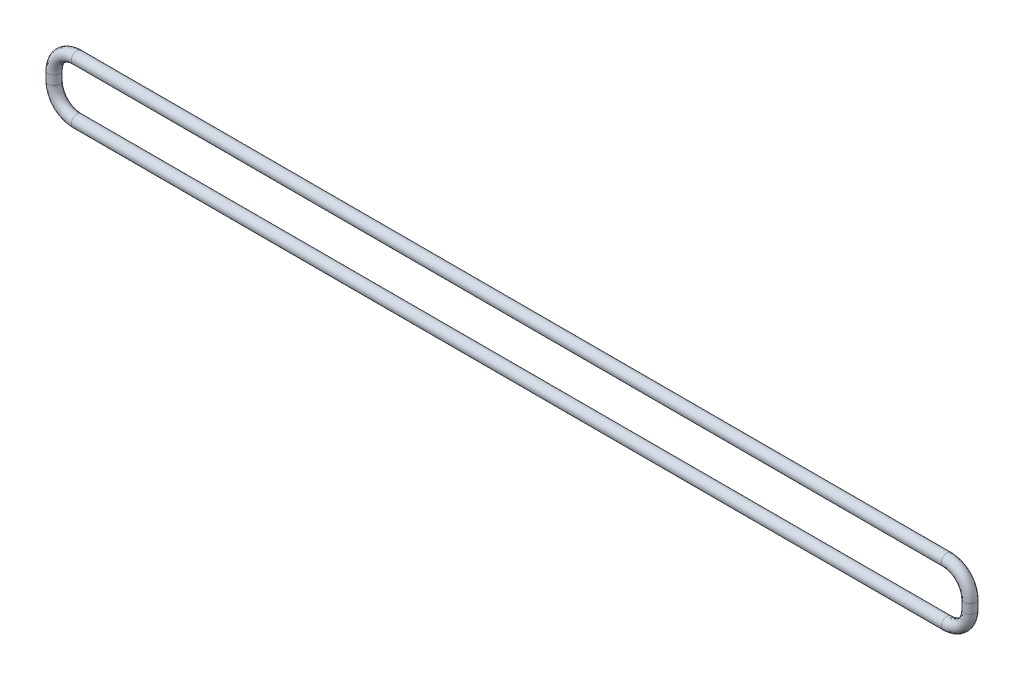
ISO-10303-21;
HEADER;
FILE_DESCRIPTION(('STEP AP214'),'2;1');
FILE_NAME('part.step','',(''),(''),'','','');
FILE_SCHEMA(('AUTOMOTIVE_DESIGN { 1 0 10303 214 1 1 1 1 }'));
ENDSEC;
DATA;
#1=APPLICATION_CONTEXT('core data for automotive mechanical design processes');
#2=APPLICATION_PROTOCOL_DEFINITION('international standard','automotive_design',2000,#1);
#3=PRODUCT_CONTEXT('',#1,'mechanical');
#4=PRODUCT('Part','Part','',(#3));
#5=PRODUCT_RELATED_PRODUCT_CATEGORY('part','',(#4));
#6=PRODUCT_DEFINITION_FORMATION('','',#4);
#7=PRODUCT_DEFINITION_CONTEXT('part definition',#1,'design');
#8=PRODUCT_DEFINITION('design','',#6,#7);
#9=PRODUCT_DEFINITION_SHAPE('','',#8);
#10=(LENGTH_UNIT() NAMED_UNIT(*) SI_UNIT(.MILLI.,.METRE.));
#11=(NAMED_UNIT(*) PLANE_ANGLE_UNIT() SI_UNIT($,.RADIAN.));
#12=(NAMED_UNIT(*) SI_UNIT($,.STERADIAN.) SOLID_ANGLE_UNIT());
#13=UNCERTAINTY_MEASURE_WITH_UNIT(LENGTH_MEASURE(1.E-05),#10,'distance_accuracy_value','');
#14=(GEOMETRIC_REPRESENTATION_CONTEXT(3) GLOBAL_UNCERTAINTY_ASSIGNED_CONTEXT((#13)) GLOBAL_UNIT_ASSIGNED_CONTEXT((#10,
#11,#12)) REPRESENTATION_CONTEXT('',''));
#15=CARTESIAN_POINT('',(0.,0.,0.));
#16=DIRECTION('',(0.,0.,1.));
#17=DIRECTION('',(1.,0.,0.));
#18=AXIS2_PLACEMENT_3D('',#15,#16,#17);
#19=CARTESIAN_POINT('',(0.,0.,0.));
#20=DIRECTION('',(1.,0.,0.));
#21=DIRECTION('',(0.,0.,-1.));
#22=AXIS2_PLACEMENT_3D('',#19,#20,#21);
#23=CYLINDRICAL_SURFACE('',#22,0.635);
#24=CARTESIAN_POINT('',(0.,0.,0.));
#25=DIRECTION('',(-1.,0.,0.));
#26=DIRECTION('',(0.,-1.,0.));
#27=AXIS2_PLACEMENT_3D('',#24,#25,#26);
#28=CIRCLE('',#27,0.635);
#29=CARTESIAN_POINT('',(0.,0.,-0.635));
#30=VERTEX_POINT('',#29);
#31=EDGE_CURVE('E125',#30,#30,#28,.T.);
#32=ORIENTED_EDGE('',*,*,#31,.F.);
#33=EDGE_LOOP('',(#32));
#34=FACE_BOUND('',#33,.T.);
#35=CARTESIAN_POINT('',(96.52,0.,0.));
#36=DIRECTION('',(1.,0.,0.));
#37=DIRECTION('',(0.,0.,-1.));
#38=AXIS2_PLACEMENT_3D('',#35,#36,#37);
#39=CIRCLE('',#38,0.635);
#40=CARTESIAN_POINT('',(96.52,0.,-0.635));
#41=VERTEX_POINT('',#40);
#42=EDGE_CURVE('E11',#41,#41,#39,.T.);
#43=ORIENTED_EDGE('',*,*,#42,.F.);
#44=EDGE_LOOP('',(#43));
#45=FACE_BOUND('',#44,.T.);
#46=ADVANCED_FACE('F96',(#34,#45),#23,.T.);
#47=CARTESIAN_POINT('',(96.52,0.,-0.635));
#48=CARTESIAN_POINT('',(96.6945160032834,0.,-0.635));
#49=CARTESIAN_POINT('',(97.0552173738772,0.0428306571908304,-0.635));
#50=CARTESIAN_POINT('',(97.5817937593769,0.217901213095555,-0.635));
#51=CARTESIAN_POINT('',(98.0799134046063,0.508172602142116,-0.635));
#52=CARTESIAN_POINT('',(98.4713572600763,0.885433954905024,-0.635));
#53=CARTESIAN_POINT('',(98.7456596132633,1.30027299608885,-0.635));
#54=CARTESIAN_POINT('',(98.9254738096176,1.70786690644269,-0.635));
#55=CARTESIAN_POINT('',(99.0338894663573,2.1238022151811,-0.635));
#56=CARTESIAN_POINT('',(99.06,2.40388157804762,-0.635));
#57=CARTESIAN_POINT('',(99.06,2.5399999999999,-0.635));
#58=CARTESIAN_POINT('',(96.52,1.27,-0.635));
#59=CARTESIAN_POINT('',(96.6945160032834,1.27,-0.635));
#60=CARTESIAN_POINT('',(96.7212588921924,1.28948688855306,-0.635));
#61=CARTESIAN_POINT('',(97.0705324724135,1.38348727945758,-0.635));
#62=CARTESIAN_POINT('',(97.3098980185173,1.53715386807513,-0.635));
#63=CARTESIAN_POINT('',(97.4867377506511,1.7017924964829,-0.635));
#64=CARTESIAN_POINT('',(97.6249533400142,1.91354304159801,-0.635));
#65=CARTESIAN_POINT('',(97.7212884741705,2.11690167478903,-0.635));
#66=CARTESIAN_POINT('',(97.7785091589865,2.388132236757,-0.635));
#67=CARTESIAN_POINT('',(97.79,2.40388157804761,-0.635));
#68=CARTESIAN_POINT('',(97.79,2.5399999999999,-0.635));
#69=CARTESIAN_POINT('',(96.52,1.27,0.635));
#70=CARTESIAN_POINT('',(96.6945160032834,1.27,0.635));
#71=CARTESIAN_POINT('',(96.7212588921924,1.28948688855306,0.635));
#72=CARTESIAN_POINT('',(97.0705324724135,1.38348727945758,0.635));
#73=CARTESIAN_POINT('',(97.3098980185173,1.53715386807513,0.635));
#74=CARTESIAN_POINT('',(97.4867377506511,1.7017924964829,0.635));
#75=CARTESIAN_POINT('',(97.6249533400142,1.91354304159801,0.635));
#76=CARTESIAN_POINT('',(97.7212884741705,2.11690167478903,0.635));
#77=CARTESIAN_POINT('',(97.7785091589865,2.388132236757,0.635));
#78=CARTESIAN_POINT('',(97.79,2.40388157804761,0.635));
#79=CARTESIAN_POINT('',(97.79,2.5399999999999,0.635));
#80=CARTESIAN_POINT('',(96.52,0.,0.635));
#81=CARTESIAN_POINT('',(96.6945160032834,0.,0.635));
#82=CARTESIAN_POINT('',(97.0552173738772,0.0428306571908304,0.635));
#83=CARTESIAN_POINT('',(97.5817937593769,0.217901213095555,0.635));
#84=CARTESIAN_POINT('',(98.0799134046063,0.508172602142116,0.635));
#85=CARTESIAN_POINT('',(98.4713572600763,0.885433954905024,0.635));
#86=CARTESIAN_POINT('',(98.7456596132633,1.30027299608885,0.635));
#87=CARTESIAN_POINT('',(98.9254738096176,1.70786690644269,0.635));
#88=CARTESIAN_POINT('',(99.0338894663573,2.1238022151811,0.635));
#89=CARTESIAN_POINT('',(99.06,2.40388157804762,0.635));
#90=CARTESIAN_POINT('',(99.06,2.5399999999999,0.635));
#91=CARTESIAN_POINT('',(96.52,-1.27,0.635));
#92=CARTESIAN_POINT('',(96.6945160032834,-1.27,0.635));
#93=CARTESIAN_POINT('',(97.3891758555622,-1.20382557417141,0.635));
#94=CARTESIAN_POINT('',(98.0930550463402,-0.947684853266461,0.635));
#95=CARTESIAN_POINT('',(98.8499287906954,-0.52080866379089,0.635));
#96=CARTESIAN_POINT('',(99.4559767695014,0.0690754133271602,0.635));
#97=CARTESIAN_POINT('',(99.8663658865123,0.687002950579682,0.635));
#98=CARTESIAN_POINT('',(100.129659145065,1.29883213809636,0.635));
#99=CARTESIAN_POINT('',(100.289269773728,1.85947219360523,0.635));
#100=CARTESIAN_POINT('',(100.33,2.40388157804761,0.635));
#101=CARTESIAN_POINT('',(100.33,2.5399999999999,0.635));
#102=CARTESIAN_POINT('',(96.52,-1.27,-0.635));
#103=CARTESIAN_POINT('',(96.6945160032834,-1.27,-0.635));
#104=CARTESIAN_POINT('',(97.3891758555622,-1.20382557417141,-0.635));
#105=CARTESIAN_POINT('',(98.0930550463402,-0.947684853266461,-0.635));
#106=CARTESIAN_POINT('',(98.8499287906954,-0.52080866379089,-0.635));
#107=CARTESIAN_POINT('',(99.4559767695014,0.0690754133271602,-0.635));
#108=CARTESIAN_POINT('',(99.8663658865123,0.687002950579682,-0.635));
#109=CARTESIAN_POINT('',(100.129659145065,1.29883213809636,-0.635));
#110=CARTESIAN_POINT('',(100.289269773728,1.85947219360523,-0.635));
#111=CARTESIAN_POINT('',(100.33,2.40388157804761,-0.635));
#112=CARTESIAN_POINT('',(100.33,2.5399999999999,-0.635));
#113=CARTESIAN_POINT('',(96.52,0.,-0.635));
#114=CARTESIAN_POINT('',(96.6945160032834,0.,-0.635));
#115=CARTESIAN_POINT('',(97.0552173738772,0.0428306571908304,-0.635));
#116=CARTESIAN_POINT('',(97.5817937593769,0.217901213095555,-0.635));
#117=CARTESIAN_POINT('',(98.0799134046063,0.508172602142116,-0.635));
#118=CARTESIAN_POINT('',(98.4713572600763,0.885433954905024,-0.635));
#119=CARTESIAN_POINT('',(98.7456596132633,1.30027299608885,-0.635));
#120=CARTESIAN_POINT('',(98.9254738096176,1.70786690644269,-0.635));
#121=CARTESIAN_POINT('',(99.0338894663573,2.1238022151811,-0.635));
#122=CARTESIAN_POINT('',(99.06,2.40388157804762,-0.635));
#123=CARTESIAN_POINT('',(99.06,2.5399999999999,-0.635));
#124=(BOUNDED_SURFACE() B_SPLINE_SURFACE(3,3,((#47,#48,#49,#50,#51,#52,#53,#54,#55,#56,#57),
(#58,#59,#60,#61,#62,#63,#64,#65,#66,#67,#68),(#69,#70,#71,#72,#73,#74,#75,#76,#77,#78,#79),
(#80,#81,#82,#83,#84,#85,#86,#87,#88,#89,#90),(#91,#92,#93,#94,#95,#96,#97,#98,#99,#100,#101),
(#102,#103,#104,#105,#106,#107,#108,#109,#110,#111,#112),(#113,#114,#115,#116,#117,#118,#119,
#120,#121,#122,#123)),.UNSPECIFIED.,.T.,.F.,.F.) B_SPLINE_SURFACE_WITH_KNOTS((4,3,4),(4,1,1,1,1,
1,1,1,4),(0.,0.5,1.),(0.,0.131621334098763,0.271465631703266,0.415936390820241,
0.562852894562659,0.677098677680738,0.789066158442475,0.897338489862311,1.),
.UNSPECIFIED.) GEOMETRIC_REPRESENTATION_ITEM() RATIONAL_B_SPLINE_SURFACE(((1.,1.,1.,1.,1.,1.,1.,
1.,1.,1.,1.),(0.333333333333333,0.333333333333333,0.333333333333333,0.333333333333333,
0.333333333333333,0.333333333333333,0.333333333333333,0.333333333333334,0.333333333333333,
0.333333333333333,0.333333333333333),(0.333333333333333,0.333333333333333,0.333333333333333,
0.333333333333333,0.333333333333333,0.333333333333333,0.333333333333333,0.333333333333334,
0.333333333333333,0.333333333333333,0.333333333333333),(1.,1.,1.,1.,1.,1.,1.,1.,1.,1.,1.),
(0.333333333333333,0.333333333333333,0.333333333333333,0.333333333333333,0.333333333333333,
0.333333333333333,0.333333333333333,0.333333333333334,0.333333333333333,0.333333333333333,
0.333333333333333),(0.333333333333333,0.333333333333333,0.333333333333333,0.333333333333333,
0.333333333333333,0.333333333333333,0.333333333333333,0.333333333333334,0.333333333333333,
0.333333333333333,0.333333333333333),(1.,1.,1.,1.,1.,1.,1.,1.,1.,1.,1.))) REPRESENTATION_ITEM('') SURFACE());
#125=CARTESIAN_POINT('',(99.06,2.5399999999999,0.));
#126=DIRECTION('',(0.,1.,0.));
#127=DIRECTION('',(0.,0.,-1.));
#128=AXIS2_PLACEMENT_3D('',#125,#126,#127);
#129=CIRCLE('',#128,0.635);
#130=CARTESIAN_POINT('',(99.06,2.5399999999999,-0.635));
#131=VERTEX_POINT('',#130);
#132=EDGE_CURVE('E103',#131,#131,#129,.T.);
#133=CARTESIAN_POINT('',(96.52,0.,-0.635));
#134=CARTESIAN_POINT('',(96.5407228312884,-2.25186136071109E-09,-0.635));
#135=CARTESIAN_POINT('',(96.5614452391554,0.000292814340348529,-0.635));
#136=CARTESIAN_POINT('',(96.6028859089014,0.00145013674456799,-0.635));
#137=CARTESIAN_POINT('',(96.6236041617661,0.0023149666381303,-0.635));
#138=CARTESIAN_POINT('',(96.6650216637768,0.00460299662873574,-0.635));
#139=CARTESIAN_POINT('',(96.685720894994,0.00602651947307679,-0.635));
#140=CARTESIAN_POINT('',(96.7270858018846,0.00941864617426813,-0.635));
#141=CARTESIAN_POINT('',(96.7477514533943,0.0113875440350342,-0.635));
#142=CARTESIAN_POINT('',(96.7890345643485,0.0158571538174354,-0.635));
#143=CARTESIAN_POINT('',(96.8096519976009,0.0183581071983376,-0.635));
#144=CARTESIAN_POINT('',(96.850824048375,0.0238786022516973,-0.635));
#145=CARTESIAN_POINT('',(96.8713786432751,0.0268983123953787,-0.635));
#146=CARTESIAN_POINT('',(96.9124103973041,0.0334430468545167,-0.635));
#147=CARTESIAN_POINT('',(96.9328875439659,0.0369681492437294,-0.635));
#148=CARTESIAN_POINT('',(96.973749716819,0.0445106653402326,-0.635));
#149=CARTESIAN_POINT('',(96.9941347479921,0.0485280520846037,-0.635));
#150=CARTESIAN_POINT('',(97.0347984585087,0.0570412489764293,-0.635));
#151=CARTESIAN_POINT('',(97.0550771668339,0.0615369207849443,-0.635));
#152=CARTESIAN_POINT('',(97.0955169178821,0.0709986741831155,-0.635));
#153=CARTESIAN_POINT('',(97.1156779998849,0.0759645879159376,-0.635));
#154=CARTESIAN_POINT('',(97.1558735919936,0.0863629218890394,-0.635));
#155=CARTESIAN_POINT('',(97.1759081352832,0.0917952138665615,-0.635));
#156=CARTESIAN_POINT('',(97.2158420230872,0.103121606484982,-0.635));
#157=CARTESIAN_POINT('',(97.2357413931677,0.109015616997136,-0.635));
#158=CARTESIAN_POINT('',(97.2753962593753,0.121260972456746,-0.635));
#159=CARTESIAN_POINT('',(97.2951517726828,0.127612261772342,-0.635));
#160=CARTESIAN_POINT('',(97.3345102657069,0.14076764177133,-0.635));
#161=CARTESIAN_POINT('',(97.3541132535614,0.147571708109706,-0.635));
#162=CARTESIAN_POINT('',(97.3931580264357,0.16162814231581,-0.635));
#163=CARTESIAN_POINT('',(97.4125998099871,0.16888051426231,-0.635));
#164=CARTESIAN_POINT('',(97.4513135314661,0.183829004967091,-0.635));
#165=CARTESIAN_POINT('',(97.4705854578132,0.191525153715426,-0.635));
#166=CARTESIAN_POINT('',(97.5089507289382,0.207356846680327,-0.635));
#167=CARTESIAN_POINT('',(97.5280440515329,0.215492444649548,-0.635));
#168=CARTESIAN_POINT('',(97.566043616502,0.23219789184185,-0.635));
#169=CARTESIAN_POINT('',(97.5849498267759,0.240767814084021,-0.635));
#170=CARTESIAN_POINT('',(97.622563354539,0.258340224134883,-0.635));
#171=CARTESIAN_POINT('',(97.6412706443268,0.267342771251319,-0.635));
#172=CARTESIAN_POINT('',(97.6784722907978,0.28578063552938,-0.635));
#173=CARTESIAN_POINT('',(97.6969666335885,0.295215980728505,-0.635));
#174=CARTESIAN_POINT('',(97.7337285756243,0.314519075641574,-0.635));
#175=CARTESIAN_POINT('',(97.7519961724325,0.324386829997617,-0.635));
#176=CARTESIAN_POINT('',(97.7882907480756,0.344554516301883,-0.635));
#177=CARTESIAN_POINT('',(97.8063177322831,0.354854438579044,-0.635));
#178=CARTESIAN_POINT('',(97.8421172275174,0.375886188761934,-0.635));
#179=CARTESIAN_POINT('',(97.8598897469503,0.386618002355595,-0.635));
#180=CARTESIAN_POINT('',(97.895166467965,0.408513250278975,-0.635));
#181=CARTESIAN_POINT('',(97.9126706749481,0.419676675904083,-0.635));
#182=CARTESIAN_POINT('',(97.9473968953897,0.442434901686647,-0.635));
#183=CARTESIAN_POINT('',(97.9646189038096,0.454029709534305,-0.635));
#184=CARTESIAN_POINT('',(97.9987670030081,0.477650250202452,-0.635));
#185=CARTESIAN_POINT('',(98.015693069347,0.489676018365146,-0.635));
#186=CARTESIAN_POINT('',(98.0492350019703,0.514158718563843,-0.635));
#187=CARTESIAN_POINT('',(98.0658508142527,0.526615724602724,-0.635));
#188=CARTESIAN_POINT('',(98.0987589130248,0.551957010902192,-0.635));
#189=CARTESIAN_POINT('',(98.115051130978,0.564841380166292,-0.635));
#190=CARTESIAN_POINT('',(98.1473008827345,0.591027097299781,-0.635));
#191=CARTESIAN_POINT('',(98.1632583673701,0.604328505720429,-0.635));
#192=CARTESIAN_POINT('',(98.194826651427,0.6313388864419,-0.635));
#193=CARTESIAN_POINT('',(98.2104374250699,0.645047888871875,-0.635));
#194=CARTESIAN_POINT('',(98.2413004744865,0.672863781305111,-0.635));
#195=CARTESIAN_POINT('',(98.2565527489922,0.686970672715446,-0.635));
#196=CARTESIAN_POINT('',(98.286686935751,0.71557273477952,-0.635));
#197=CARTESIAN_POINT('',(98.3015688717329,0.730067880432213,-0.635));
#198=CARTESIAN_POINT('',(98.3309505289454,0.759436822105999,-0.635));
#199=CARTESIAN_POINT('',(98.3454502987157,0.774310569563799,-0.635));
#200=CARTESIAN_POINT('',(98.374055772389,0.804427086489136,-0.635));
#201=CARTESIAN_POINT('',(98.3881615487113,0.819669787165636,-0.635));
#202=CARTESIAN_POINT('',(98.4159671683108,0.850514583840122,-0.635));
#203=CARTESIAN_POINT('',(98.4296671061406,0.866116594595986,-0.635));
#204=CARTESIAN_POINT('',(98.4566492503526,0.897670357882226,-0.635));
#205=CARTESIAN_POINT('',(98.4699315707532,0.913622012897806,-0.635));
#206=CARTESIAN_POINT('',(98.4960667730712,0.945865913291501,-0.635));
#207=CARTESIAN_POINT('',(98.5089197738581,0.962158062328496,-0.635));
#208=CARTESIAN_POINT('',(98.5341962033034,0.995067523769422,-0.635));
#209=CARTESIAN_POINT('',(98.5466197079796,1.01168477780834,-0.635));
#210=CARTESIAN_POINT('',(98.5710377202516,1.04522944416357,-0.635));
#211=CARTESIAN_POINT('',(98.5830322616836,1.06215683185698,-0.635));
#212=CARTESIAN_POINT('',(98.6065928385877,1.09630680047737,-0.635));
#213=CARTESIAN_POINT('',(98.6181588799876,1.11352937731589,-0.635));
#214=CARTESIAN_POINT('',(98.6408629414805,1.14825477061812,-0.635));
#215=CARTESIAN_POINT('',(98.6520009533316,1.16575759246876,-0.635));
#216=CARTESIAN_POINT('',(98.6738494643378,1.20102851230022,-0.635));
#217=CARTESIAN_POINT('',(98.6845599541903,1.21879661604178,-0.635));
#218=CARTESIAN_POINT('',(98.7055537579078,1.25458322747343,-0.635));
#219=CARTESIAN_POINT('',(98.7158370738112,1.2726017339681,-0.635));
#220=CARTESIAN_POINT('',(98.7359775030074,1.30887406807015,-0.635));
#221=CARTESIAN_POINT('',(98.7458346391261,1.32712788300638,-0.635));
#222=CARTESIAN_POINT('',(98.7651207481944,1.36385879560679,-0.635));
#223=CARTESIAN_POINT('',(98.7745497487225,1.38233587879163,-0.635));
#224=CARTESIAN_POINT('',(98.7929763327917,1.41950283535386,-0.635));
#225=CARTESIAN_POINT('',(98.8019739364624,1.43819269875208,-0.635));
#226=CARTESIAN_POINT('',(98.8195348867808,1.47577451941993,-0.635));
#227=CARTESIAN_POINT('',(98.8280982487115,1.4946664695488,-0.635));
#228=CARTESIAN_POINT('',(98.8447877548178,1.53264183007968,-0.635));
#229=CARTESIAN_POINT('',(98.8529139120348,1.55172523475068,-0.635));
#230=CARTESIAN_POINT('',(98.8687261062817,1.59007284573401,-0.635));
#231=CARTESIAN_POINT('',(98.8764121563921,1.60933704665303,-0.635));
#232=CARTESIAN_POINT('',(98.8913411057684,1.64803563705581,-0.635));
#233=CARTESIAN_POINT('',(98.8985840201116,1.66747002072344,-0.635));
#234=CARTESIAN_POINT('',(98.9126241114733,1.70649822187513,-0.635));
#235=CARTESIAN_POINT('',(98.9194213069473,1.72609203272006,-0.635));
#236=CARTESIAN_POINT('',(98.9325653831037,1.76542930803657,-0.635));
#237=CARTESIAN_POINT('',(98.9389122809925,1.78517276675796,-0.635));
#238=CARTESIAN_POINT('',(98.9511491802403,1.8248004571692,-0.635));
#239=CARTESIAN_POINT('',(98.9570391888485,1.84468468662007,-0.635));
#240=CARTESIAN_POINT('',(98.9683561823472,1.88458489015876,-0.635));
#241=CARTESIAN_POINT('',(98.9737831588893,1.90460086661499,-0.635));
#242=CARTESIAN_POINT('',(98.9841678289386,1.94475557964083,-0.635));
#243=CARTESIAN_POINT('',(98.9891254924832,1.96489432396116,-0.635));
#244=CARTESIAN_POINT('',(98.9985653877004,2.00528556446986,-0.635));
#245=CARTESIAN_POINT('',(99.003047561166,2.02553807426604,-0.635));
#246=CARTESIAN_POINT('',(99.0115300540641,2.06614788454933,-0.635));
#247=CARTESIAN_POINT('',(99.0155302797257,2.08650520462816,-0.635));
#248=CARTESIAN_POINT('',(99.023043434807,2.12731527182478,-0.635));
#249=CARTESIAN_POINT('',(99.0265562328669,2.14776804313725,-0.635));
#250=CARTESIAN_POINT('',(99.0330833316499,2.18875662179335,-0.635));
#251=CARTESIAN_POINT('',(99.0360975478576,2.20929244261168,-0.635));
#252=CARTESIAN_POINT('',(99.0416117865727,2.25043200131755,-0.635));
#253=CARTESIAN_POINT('',(99.044111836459,2.27103573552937,-0.635));
#254=CARTESIAN_POINT('',(99.0485828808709,2.31229575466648,-0.635));
#255=CARTESIAN_POINT('',(99.050553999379,2.33295202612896,-0.635));
#256=CARTESIAN_POINT('',(99.0539521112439,2.37430176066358,-0.635));
#257=CARTESIAN_POINT('',(99.0553793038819,2.39499520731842,-0.635));
#258=CARTESIAN_POINT('',(99.0576745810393,2.43640400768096,-0.635));
#259=CARTESIAN_POINT('',(99.0585429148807,2.45711934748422,-0.635));
#260=CARTESIAN_POINT('',(99.059705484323,2.4985563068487,-0.635));
#261=CARTESIAN_POINT('',(99.0599999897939,2.51927791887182,-0.635));
#262=CARTESIAN_POINT('',(99.06,2.5399999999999,-0.635));
#263=B_SPLINE_CURVE_WITH_KNOTS('',3,(#133,#134,#135,#136,#137,#138,#139,#140,#141,#142,#143,
#144,#145,#146,#147,#148,#149,#150,#151,#152,#153,#154,#155,#156,#157,#158,#159,#160,#161,#162,
#163,#164,#165,#166,#167,#168,#169,#170,#171,#172,#173,#174,#175,#176,#177,#178,#179,#180,#181,
#182,#183,#184,#185,#186,#187,#188,#189,#190,#191,#192,#193,#194,#195,#196,#197,#198,#199,#200,
#201,#202,#203,#204,#205,#206,#207,#208,#209,#210,#211,#212,#213,#214,#215,#216,#217,#218,#219,
#220,#221,#222,#223,#224,#225,#226,#227,#228,#229,#230,#231,#232,#233,#234,#235,#236,#237,#238,
#239,#240,#241,#242,#243,#244,#245,#246,#247,#248,#249,#250,#251,#252,#253,#254,#255,#256,#257,
#258,#259,#260,#261,#262),.UNSPECIFIED.,.F.,.F.,(4,2,2,2,2,2,2,2,2,2,2,2,2,2,2,2,2,2,2,2,2,2,2,
2,2,2,2,2,2,2,2,2,2,2,2,2,2,2,2,2,2,2,2,2,2,2,2,2,2,2,2,2,2,2,2,2,2,2,2,2,2,2,2,2,4),(0.,
0.0621658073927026,0.124366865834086,0.186603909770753,0.248874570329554,0.311173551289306,
0.373492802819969,0.435821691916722,0.498147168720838,0.560454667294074,0.62274000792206,
0.68500827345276,0.747264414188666,0.809512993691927,0.87175822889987,0.934004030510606,
0.996254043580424,1.05851168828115,1.12077983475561,1.18305654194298,1.24533728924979,
1.3076187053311,1.3698987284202,1.43217668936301,1.49445339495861,1.55673121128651,
1.61901414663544,1.68130782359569,1.74361455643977,1.80593037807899,1.86825081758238,
1.93057147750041,1.99288813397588,2.05519683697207,2.11749401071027,2.17977655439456,
2.24204194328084,2.3042899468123,2.36652687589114,2.42875888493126,2.49099003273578,
2.55322237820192,2.6154560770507,2.67768947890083,2.73991954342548,2.80214559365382,
2.86436873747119,2.92658968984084,2.98880878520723,3.05102603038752,3.11324115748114,
3.175453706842,3.23766387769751,3.29987306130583,3.3620833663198,3.42429764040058,
3.48651952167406,3.54875348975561,3.61100419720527,3.67326544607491,3.73552337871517,
3.79776670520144,3.85998720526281,3.92217992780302,3.98434339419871),.UNSPECIFIED.);
#264=EDGE_CURVE('BSEAM133',#41,#131,#263,.T.);
#265=ORIENTED_EDGE('',*,*,#42,.T.);
#266=ORIENTED_EDGE('',*,*,#132,.F.);
#267=ORIENTED_EDGE('',*,*,#264,.T.);
#268=ORIENTED_EDGE('',*,*,#264,.F.);
#269=EDGE_LOOP('',(#265,#267,#266,#268));
#270=FACE_BOUND('',#269,.T.);
#271=ADVANCED_FACE('F133',(#270),#124,.T.);
#272=CARTESIAN_POINT('',(99.06,2.5399999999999,0.));
#273=DIRECTION('',(0.,1.,0.));
#274=DIRECTION('',(0.,0.,1.));
#275=AXIS2_PLACEMENT_3D('',#272,#273,#274);
#276=CYLINDRICAL_SURFACE('',#275,0.635);
#277=ORIENTED_EDGE('',*,*,#132,.T.);
#278=EDGE_LOOP('',(#277));
#279=FACE_BOUND('',#278,.T.);
#280=CARTESIAN_POINT('',(99.06,3.5559999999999,0.));
#281=DIRECTION('',(0.,1.,0.));
#282=DIRECTION('',(0.,0.,-1.));
#283=AXIS2_PLACEMENT_3D('',#280,#281,#282);
#284=CIRCLE('',#283,0.635);
#285=CARTESIAN_POINT('',(99.06,3.5559999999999,-0.635));
#286=VERTEX_POINT('',#285);
#287=EDGE_CURVE('E107',#286,#286,#284,.T.);
#288=ORIENTED_EDGE('',*,*,#287,.F.);
#289=EDGE_LOOP('',(#288));
#290=FACE_BOUND('',#289,.T.);
#291=ADVANCED_FACE('F138',(#279,#290),#276,.T.);
#292=CARTESIAN_POINT('',(99.06,3.5559999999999,-0.635));
#293=CARTESIAN_POINT('',(99.06,3.7305160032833,-0.635));
#294=CARTESIAN_POINT('',(99.0171693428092,4.09121737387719,-0.635));
#295=CARTESIAN_POINT('',(98.8420987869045,4.61779375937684,-0.635));
#296=CARTESIAN_POINT('',(98.5518273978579,5.11591340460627,-0.635));
#297=CARTESIAN_POINT('',(98.174566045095,5.50735726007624,-0.635));
#298=CARTESIAN_POINT('',(97.7597270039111,5.78165961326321,-0.635));
#299=CARTESIAN_POINT('',(97.3521330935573,5.96147380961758,-0.635));
#300=CARTESIAN_POINT('',(96.9361977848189,6.06988946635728,-0.635));
#301=CARTESIAN_POINT('',(96.6561184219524,6.09599999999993,-0.635));
#302=CARTESIAN_POINT('',(96.5200000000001,6.09599999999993,-0.635));
#303=CARTESIAN_POINT('',(97.79,3.5559999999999,-0.635));
#304=CARTESIAN_POINT('',(97.79,3.7305160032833,-0.635));
#305=CARTESIAN_POINT('',(97.770513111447,3.75725889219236,-0.635));
#306=CARTESIAN_POINT('',(97.6765127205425,4.10653247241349,-0.635));
#307=CARTESIAN_POINT('',(97.5228461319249,4.34589801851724,-0.635));
#308=CARTESIAN_POINT('',(97.3582075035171,4.52273775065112,-0.635));
#309=CARTESIAN_POINT('',(97.1464569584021,4.66095334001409,-0.635));
#310=CARTESIAN_POINT('',(96.9430983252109,4.75728847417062,-0.635));
#311=CARTESIAN_POINT('',(96.6718677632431,4.81450915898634,-0.635));
#312=CARTESIAN_POINT('',(96.6561184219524,4.82599999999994,-0.635));
#313=CARTESIAN_POINT('',(96.5200000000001,4.82599999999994,-0.635));
#314=CARTESIAN_POINT('',(97.79,3.5559999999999,0.635));
#315=CARTESIAN_POINT('',(97.79,3.7305160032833,0.635));
#316=CARTESIAN_POINT('',(97.770513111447,3.75725889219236,0.635));
#317=CARTESIAN_POINT('',(97.6765127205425,4.10653247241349,0.635));
#318=CARTESIAN_POINT('',(97.5228461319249,4.34589801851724,0.635));
#319=CARTESIAN_POINT('',(97.3582075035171,4.52273775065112,0.635));
#320=CARTESIAN_POINT('',(97.1464569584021,4.66095334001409,0.635));
#321=CARTESIAN_POINT('',(96.9430983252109,4.75728847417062,0.635));
#322=CARTESIAN_POINT('',(96.6718677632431,4.81450915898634,0.635));
#323=CARTESIAN_POINT('',(96.6561184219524,4.82599999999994,0.635));
#324=CARTESIAN_POINT('',(96.5200000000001,4.82599999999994,0.635));
#325=CARTESIAN_POINT('',(99.06,3.5559999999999,0.635));
#326=CARTESIAN_POINT('',(99.06,3.7305160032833,0.635));
#327=CARTESIAN_POINT('',(99.0171693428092,4.09121737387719,0.635));
#328=CARTESIAN_POINT('',(98.8420987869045,4.61779375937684,0.635));
#329=CARTESIAN_POINT('',(98.5518273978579,5.11591340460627,0.635));
#330=CARTESIAN_POINT('',(98.174566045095,5.50735726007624,0.635));
#331=CARTESIAN_POINT('',(97.7597270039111,5.78165961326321,0.635));
#332=CARTESIAN_POINT('',(97.3521330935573,5.96147380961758,0.635));
#333=CARTESIAN_POINT('',(96.9361977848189,6.06988946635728,0.635));
#334=CARTESIAN_POINT('',(96.6561184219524,6.09599999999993,0.635));
#335=CARTESIAN_POINT('',(96.5200000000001,6.09599999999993,0.635));
#336=CARTESIAN_POINT('',(100.33,3.5559999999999,0.635));
#337=CARTESIAN_POINT('',(100.33,3.7305160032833,0.635));
#338=CARTESIAN_POINT('',(100.263825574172,4.42517585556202,0.635));
#339=CARTESIAN_POINT('',(100.007684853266,5.12905504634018,0.635));
#340=CARTESIAN_POINT('',(99.5808086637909,5.88592879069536,0.635));
#341=CARTESIAN_POINT('',(98.9909245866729,6.49197676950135,0.635));
#342=CARTESIAN_POINT('',(98.3729970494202,6.90236588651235,0.635));
#343=CARTESIAN_POINT('',(97.7611678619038,7.16565914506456,0.635));
#344=CARTESIAN_POINT('',(97.2005278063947,7.32526977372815,0.635));
#345=CARTESIAN_POINT('',(96.6561184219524,7.36599999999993,0.635));
#346=CARTESIAN_POINT('',(96.5200000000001,7.36599999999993,0.635));
#347=CARTESIAN_POINT('',(100.33,3.5559999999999,-0.635));
#348=CARTESIAN_POINT('',(100.33,3.7305160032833,-0.635));
#349=CARTESIAN_POINT('',(100.263825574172,4.42517585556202,-0.635));
#350=CARTESIAN_POINT('',(100.007684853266,5.12905504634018,-0.635));
#351=CARTESIAN_POINT('',(99.5808086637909,5.88592879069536,-0.635));
#352=CARTESIAN_POINT('',(98.9909245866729,6.49197676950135,-0.635));
#353=CARTESIAN_POINT('',(98.3729970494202,6.90236588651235,-0.635));
#354=CARTESIAN_POINT('',(97.7611678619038,7.16565914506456,-0.635));
#355=CARTESIAN_POINT('',(97.2005278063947,7.32526977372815,-0.635));
#356=CARTESIAN_POINT('',(96.6561184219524,7.36599999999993,-0.635));
#357=CARTESIAN_POINT('',(96.5200000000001,7.36599999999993,-0.635));
#358=CARTESIAN_POINT('',(99.06,3.5559999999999,-0.635));
#359=CARTESIAN_POINT('',(99.06,3.7305160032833,-0.635));
#360=CARTESIAN_POINT('',(99.0171693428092,4.09121737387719,-0.635));
#361=CARTESIAN_POINT('',(98.8420987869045,4.61779375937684,-0.635));
#362=CARTESIAN_POINT('',(98.5518273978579,5.11591340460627,-0.635));
#363=CARTESIAN_POINT('',(98.174566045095,5.50735726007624,-0.635));
#364=CARTESIAN_POINT('',(97.7597270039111,5.78165961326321,-0.635));
#365=CARTESIAN_POINT('',(97.3521330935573,5.96147380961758,-0.635));
#366=CARTESIAN_POINT('',(96.9361977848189,6.06988946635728,-0.635));
#367=CARTESIAN_POINT('',(96.6561184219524,6.09599999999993,-0.635));
#368=CARTESIAN_POINT('',(96.5200000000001,6.09599999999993,-0.635));
#369=(BOUNDED_SURFACE() B_SPLINE_SURFACE(3,3,((#292,#293,#294,#295,#296,#297,#298,#299,#300,
#301,#302),(#303,#304,#305,#306,#307,#308,#309,#310,#311,#312,#313),(#314,#315,#316,#317,#318,
#319,#320,#321,#322,#323,#324),(#325,#326,#327,#328,#329,#330,#331,#332,#333,#334,#335),(#336,
#337,#338,#339,#340,#341,#342,#343,#344,#345,#346),(#347,#348,#349,#350,#351,#352,#353,#354,
#355,#356,#357),(#358,#359,#360,#361,#362,#363,#364,#365,#366,#367,#368)),.UNSPECIFIED.,.T.,.F.,
.F.) B_SPLINE_SURFACE_WITH_KNOTS((4,3,4),(4,1,1,1,1,1,1,1,4),(0.,0.5,1.),(0.,0.131621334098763,
0.271465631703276,0.415936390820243,0.56285289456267,0.677098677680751,0.78906615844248,
0.897338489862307,1.),
.UNSPECIFIED.) GEOMETRIC_REPRESENTATION_ITEM() RATIONAL_B_SPLINE_SURFACE(((1.,1.,1.,
0.999999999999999,1.,1.,1.,1.,1.,1.,1.),(0.333333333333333,0.333333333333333,0.333333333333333,
0.333333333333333,0.333333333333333,0.333333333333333,0.333333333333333,0.333333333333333,
0.333333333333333,0.333333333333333,0.333333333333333),(0.333333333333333,0.333333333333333,
0.333333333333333,0.333333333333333,0.333333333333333,0.333333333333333,0.333333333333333,
0.333333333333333,0.333333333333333,0.333333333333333,0.333333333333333),(1.,1.,1.,
0.999999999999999,1.,1.,1.,1.,1.,1.,1.),(0.333333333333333,0.333333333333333,0.333333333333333,
0.333333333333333,0.333333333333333,0.333333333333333,0.333333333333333,0.333333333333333,
0.333333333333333,0.333333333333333,0.333333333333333),(0.333333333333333,0.333333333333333,
0.333333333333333,0.333333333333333,0.333333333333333,0.333333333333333,0.333333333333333,
0.333333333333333,0.333333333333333,0.333333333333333,0.333333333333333),(1.,1.,1.,
0.999999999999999,1.,1.,1.,1.,1.,1.,1.))) REPRESENTATION_ITEM('') SURFACE());
#370=CARTESIAN_POINT('',(96.5200000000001,6.09599999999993,0.));
#371=DIRECTION('',(-1.,0.,0.));
#372=DIRECTION('',(0.,0.,-1.));
#373=AXIS2_PLACEMENT_3D('',#370,#371,#372);
#374=CIRCLE('',#373,0.635);
#375=CARTESIAN_POINT('',(96.5200000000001,6.09599999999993,-0.635));
#376=VERTEX_POINT('',#375);
#377=EDGE_CURVE('E111',#376,#376,#374,.T.);
#378=CARTESIAN_POINT('',(99.06,3.5559999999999,-0.635));
#379=CARTESIAN_POINT('',(99.0600000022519,3.57672283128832,-0.635));
#380=CARTESIAN_POINT('',(99.0597071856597,3.59744523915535,-0.635));
#381=CARTESIAN_POINT('',(99.0585498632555,3.63888590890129,-0.635));
#382=CARTESIAN_POINT('',(99.0576850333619,3.65960416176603,-0.635));
#383=CARTESIAN_POINT('',(99.0553970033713,3.70102166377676,-0.635));
#384=CARTESIAN_POINT('',(99.0539734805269,3.72172089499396,-0.635));
#385=CARTESIAN_POINT('',(99.0505813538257,3.76308580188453,-0.635));
#386=CARTESIAN_POINT('',(99.048612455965,3.78375145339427,-0.635));
#387=CARTESIAN_POINT('',(99.0441428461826,3.82503456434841,-0.635));
#388=CARTESIAN_POINT('',(99.0416418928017,3.84565199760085,-0.635));
#389=CARTESIAN_POINT('',(99.0361213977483,3.88682404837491,-0.635));
#390=CARTESIAN_POINT('',(99.0331016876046,3.90737864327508,-0.635));
#391=CARTESIAN_POINT('',(99.0265569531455,3.94841039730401,-0.635));
#392=CARTESIAN_POINT('',(99.0230318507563,3.96888754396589,-0.635));
#393=CARTESIAN_POINT('',(99.0154893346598,4.00974971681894,-0.635));
#394=CARTESIAN_POINT('',(99.0114719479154,4.03013474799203,-0.635));
#395=CARTESIAN_POINT('',(99.0029587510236,4.07079845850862,-0.635));
#396=CARTESIAN_POINT('',(98.9984630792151,4.09107716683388,-0.635));
#397=CARTESIAN_POINT('',(98.9890013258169,4.13151691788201,-0.635));
#398=CARTESIAN_POINT('',(98.9840354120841,4.15167799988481,-0.635));
#399=CARTESIAN_POINT('',(98.973637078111,4.19187359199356,-0.635));
#400=CARTESIAN_POINT('',(98.9682047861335,4.21190813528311,-0.635));
#401=CARTESIAN_POINT('',(98.9568783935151,4.25184202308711,-0.635));
#402=CARTESIAN_POINT('',(98.9509843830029,4.27174139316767,-0.635));
#403=CARTESIAN_POINT('',(98.9387390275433,4.31139625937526,-0.635));
#404=CARTESIAN_POINT('',(98.9323877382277,4.33115177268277,-0.635));
#405=CARTESIAN_POINT('',(98.9192323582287,4.37051026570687,-0.635));
#406=CARTESIAN_POINT('',(98.9124282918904,4.3901132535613,-0.635));
#407=CARTESIAN_POINT('',(98.8983718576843,4.42915802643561,-0.635));
#408=CARTESIAN_POINT('',(98.8911194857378,4.448599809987,-0.635));
#409=CARTESIAN_POINT('',(98.876170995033,4.48731353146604,-0.635));
#410=CARTESIAN_POINT('',(98.8684748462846,4.50658545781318,-0.635));
#411=CARTESIAN_POINT('',(98.8526431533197,4.54495072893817,-0.635));
#412=CARTESIAN_POINT('',(98.8445075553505,4.56404405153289,-0.635));
#413=CARTESIAN_POINT('',(98.8278021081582,4.60204361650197,-0.635));
#414=CARTESIAN_POINT('',(98.819232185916,4.62094982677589,-0.635));
#415=CARTESIAN_POINT('',(98.8016597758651,4.65856335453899,-0.635));
#416=CARTESIAN_POINT('',(98.7926572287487,4.67727064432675,-0.635));
#417=CARTESIAN_POINT('',(98.7742193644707,4.71447229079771,-0.635));
#418=CARTESIAN_POINT('',(98.7647840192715,4.73296663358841,-0.635));
#419=CARTESIAN_POINT('',(98.7454809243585,4.76972857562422,-0.635));
#420=CARTESIAN_POINT('',(98.7356131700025,4.78799617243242,-0.635));
#421=CARTESIAN_POINT('',(98.7154454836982,4.82429074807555,-0.635));
#422=CARTESIAN_POINT('',(98.705145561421,4.84231773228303,-0.635));
#423=CARTESIAN_POINT('',(98.6841138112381,4.87811722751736,-0.635));
#424=CARTESIAN_POINT('',(98.6733819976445,4.89588974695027,-0.635));
#425=CARTESIAN_POINT('',(98.6514867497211,4.93116646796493,-0.635));
#426=CARTESIAN_POINT('',(98.640323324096,4.94867067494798,-0.635));
#427=CARTESIAN_POINT('',(98.6175650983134,4.98339689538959,-0.635));
#428=CARTESIAN_POINT('',(98.6059702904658,5.00061890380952,-0.635));
#429=CARTESIAN_POINT('',(98.5823497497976,5.03476700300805,-0.635));
#430=CARTESIAN_POINT('',(98.5703239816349,5.0516930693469,-0.635));
#431=CARTESIAN_POINT('',(98.5458412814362,5.08523500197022,-0.635));
#432=CARTESIAN_POINT('',(98.5333842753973,5.10185081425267,-0.635));
#433=CARTESIAN_POINT('',(98.5080429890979,5.13475891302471,-0.635));
#434=CARTESIAN_POINT('',(98.4951586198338,5.15105113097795,-0.635));
#435=CARTESIAN_POINT('',(98.4689729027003,5.18330088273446,-0.635));
#436=CARTESIAN_POINT('',(98.4556714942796,5.19925836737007,-0.635));
#437=CARTESIAN_POINT('',(98.4286611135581,5.23082665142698,-0.635));
#438=CARTESIAN_POINT('',(98.4149521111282,5.24643742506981,-0.635));
#439=CARTESIAN_POINT('',(98.3871362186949,5.27730047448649,-0.635));
#440=CARTESIAN_POINT('',(98.3730293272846,5.2925527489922,-0.635));
#441=CARTESIAN_POINT('',(98.3444272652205,5.32268693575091,-0.635));
#442=CARTESIAN_POINT('',(98.3299321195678,5.33756887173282,-0.635));
#443=CARTESIAN_POINT('',(98.300563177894,5.36695052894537,-0.635));
#444=CARTESIAN_POINT('',(98.2856894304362,5.38145029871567,-0.635));
#445=CARTESIAN_POINT('',(98.2555729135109,5.41005577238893,-0.635));
#446=CARTESIAN_POINT('',(98.2403302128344,5.42416154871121,-0.635));
#447=CARTESIAN_POINT('',(98.2094854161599,5.45196716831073,-0.635));
#448=CARTESIAN_POINT('',(98.193883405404,5.46566710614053,-0.635));
#449=CARTESIAN_POINT('',(98.1623296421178,5.49264925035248,-0.635));
#450=CARTESIAN_POINT('',(98.1463779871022,5.50593157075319,-0.635));
#451=CARTESIAN_POINT('',(98.1141340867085,5.53206677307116,-0.635));
#452=CARTESIAN_POINT('',(98.0978419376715,5.54491977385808,-0.635));
#453=CARTESIAN_POINT('',(98.0649324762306,5.57019620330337,-0.635));
#454=CARTESIAN_POINT('',(98.0483152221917,5.5826197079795,-0.635));
#455=CARTESIAN_POINT('',(98.0147705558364,5.60703772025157,-0.635));
#456=CARTESIAN_POINT('',(97.997843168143,5.61903226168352,-0.635));
#457=CARTESIAN_POINT('',(97.9636931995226,5.64259283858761,-0.635));
#458=CARTESIAN_POINT('',(97.9464706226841,5.65415887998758,-0.635));
#459=CARTESIAN_POINT('',(97.9117452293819,5.67686294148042,-0.635));
#460=CARTESIAN_POINT('',(97.8942424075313,5.68800095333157,-0.635));
#461=CARTESIAN_POINT('',(97.8589714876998,5.70984946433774,-0.635));
#462=CARTESIAN_POINT('',(97.8412033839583,5.72055995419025,-0.635));
#463=CARTESIAN_POINT('',(97.8054167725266,5.74155375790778,-0.635));
#464=CARTESIAN_POINT('',(97.7873982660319,5.75183707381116,-0.635));
#465=CARTESIAN_POINT('',(97.7511259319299,5.77197750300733,-0.635));
#466=CARTESIAN_POINT('',(97.7328721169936,5.78183463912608,-0.635));
#467=CARTESIAN_POINT('',(97.6961412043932,5.80112074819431,-0.635));
#468=CARTESIAN_POINT('',(97.6776641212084,5.81054974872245,-0.635));
#469=CARTESIAN_POINT('',(97.6404971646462,5.8289763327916,-0.635));
#470=CARTESIAN_POINT('',(97.621807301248,5.83797393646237,-0.635));
#471=CARTESIAN_POINT('',(97.5842254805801,5.85553488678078,-0.635));
#472=CARTESIAN_POINT('',(97.5653335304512,5.86409824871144,-0.635));
#473=CARTESIAN_POINT('',(97.5273581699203,5.88078775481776,-0.635));
#474=CARTESIAN_POINT('',(97.5082747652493,5.8889139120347,-0.635));
#475=CARTESIAN_POINT('',(97.469927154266,5.90472610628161,-0.635));
#476=CARTESIAN_POINT('',(97.450662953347,5.91241215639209,-0.635));
#477=CARTESIAN_POINT('',(97.4119643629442,5.92734110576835,-0.635));
#478=CARTESIAN_POINT('',(97.3925299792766,5.93458402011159,-0.635));
#479=CARTESIAN_POINT('',(97.3535017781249,5.94862411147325,-0.635));
#480=CARTESIAN_POINT('',(97.33390796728,5.95542130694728,-0.635));
#481=CARTESIAN_POINT('',(97.2945706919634,5.96856538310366,-0.635));
#482=CARTESIAN_POINT('',(97.2748272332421,5.97491228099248,-0.635));
#483=CARTESIAN_POINT('',(97.2351995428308,5.9871491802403,-0.635));
#484=CARTESIAN_POINT('',(97.21531531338,5.99303918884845,-0.635));
#485=CARTESIAN_POINT('',(97.1754151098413,6.0043561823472,-0.635));
#486=CARTESIAN_POINT('',(97.155399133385,6.00978315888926,-0.635));
#487=CARTESIAN_POINT('',(97.1152444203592,6.02016782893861,-0.635));
#488=CARTESIAN_POINT('',(97.0951056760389,6.02512549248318,-0.635));
#489=CARTESIAN_POINT('',(97.0547144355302,6.03456538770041,-0.635));
#490=CARTESIAN_POINT('',(97.034461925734,6.03904756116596,-0.635));
#491=CARTESIAN_POINT('',(96.9938521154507,6.04753005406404,-0.635));
#492=CARTESIAN_POINT('',(96.9734947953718,6.05153027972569,-0.635));
#493=CARTESIAN_POINT('',(96.9326847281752,6.05904343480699,-0.635));
#494=CARTESIAN_POINT('',(96.9122319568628,6.06255623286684,-0.635));
#495=CARTESIAN_POINT('',(96.8712433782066,6.06908333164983,-0.635));
#496=CARTESIAN_POINT('',(96.8507075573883,6.07209754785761,-0.635));
#497=CARTESIAN_POINT('',(96.8095679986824,6.07761178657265,-0.635));
#498=CARTESIAN_POINT('',(96.7889642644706,6.08011183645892,-0.635));
#499=CARTESIAN_POINT('',(96.7477042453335,6.08458288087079,-0.635));
#500=CARTESIAN_POINT('',(96.727047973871,6.08655399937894,-0.635));
#501=CARTESIAN_POINT('',(96.6856982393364,6.08995211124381,-0.635));
#502=CARTESIAN_POINT('',(96.6650047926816,6.09137930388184,-0.635));
#503=CARTESIAN_POINT('',(96.623595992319,6.09367458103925,-0.635));
#504=CARTESIAN_POINT('',(96.6028806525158,6.09454291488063,-0.635));
#505=CARTESIAN_POINT('',(96.5614436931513,6.0957054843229,-0.635));
#506=CARTESIAN_POINT('',(96.5407220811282,6.0959999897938,-0.635));
#507=CARTESIAN_POINT('',(96.5200000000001,6.09599999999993,-0.635));
#508=B_SPLINE_CURVE_WITH_KNOTS('',3,(#378,#379,#380,#381,#382,#383,#384,#385,#386,#387,#388,
#389,#390,#391,#392,#393,#394,#395,#396,#397,#398,#399,#400,#401,#402,#403,#404,#405,#406,#407,
#408,#409,#410,#411,#412,#413,#414,#415,#416,#417,#418,#419,#420,#421,#422,#423,#424,#425,#426,
#427,#428,#429,#430,#431,#432,#433,#434,#435,#436,#437,#438,#439,#440,#441,#442,#443,#444,#445,
#446,#447,#448,#449,#450,#451,#452,#453,#454,#455,#456,#457,#458,#459,#460,#461,#462,#463,#464,
#465,#466,#467,#468,#469,#470,#471,#472,#473,#474,#475,#476,#477,#478,#479,#480,#481,#482,#483,
#484,#485,#486,#487,#488,#489,#490,#491,#492,#493,#494,#495,#496,#497,#498,#499,#500,#501,#502,
#503,#504,#505,#506,#507),.UNSPECIFIED.,.F.,.F.,(4,2,2,2,2,2,2,2,2,2,2,2,2,2,2,2,2,2,2,2,2,2,2,
2,2,2,2,2,2,2,2,2,2,2,2,2,2,2,2,2,2,2,2,2,2,2,2,2,2,2,2,2,2,2,2,2,2,2,2,2,2,2,2,2,4),(0.,
0.0621658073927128,0.12436686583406,0.186603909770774,0.248874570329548,0.311173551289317,
0.373492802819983,0.43582169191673,0.498147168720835,0.560454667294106,0.622740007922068,
0.685008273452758,0.747264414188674,0.809512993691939,0.871758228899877,0.93400403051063,
0.996254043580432,1.05851168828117,1.12077983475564,1.18305654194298,1.24533728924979,
1.30761870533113,1.36989872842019,1.43217668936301,1.4944533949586,1.55673121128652,
1.61901414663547,1.68130782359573,1.74361455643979,1.80593037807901,1.86825081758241,
1.93057147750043,1.99288813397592,2.0551968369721,2.11749401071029,2.1797765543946,
2.24204194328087,2.30428994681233,2.36652687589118,2.42875888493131,2.49099003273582,
2.55322237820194,2.61545607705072,2.67768947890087,2.73991954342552,2.80214559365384,
2.86436873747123,2.92658968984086,2.98880878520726,3.05102603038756,3.11324115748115,
3.17545370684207,3.23766387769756,3.29987306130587,3.36208336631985,3.42429764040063,
3.48651952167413,3.54875348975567,3.61100419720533,3.67326544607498,3.73552337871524,
3.79776670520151,3.85998720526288,3.92217992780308,3.98434339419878),.UNSPECIFIED.);
#509=EDGE_CURVE('BSEAM145',#286,#376,#508,.T.);
#510=ORIENTED_EDGE('',*,*,#287,.T.);
#511=ORIENTED_EDGE('',*,*,#377,.F.);
#512=ORIENTED_EDGE('',*,*,#509,.T.);
#513=ORIENTED_EDGE('',*,*,#509,.F.);
#514=EDGE_LOOP('',(#510,#512,#511,#513));
#515=FACE_BOUND('',#514,.T.);
#516=ADVANCED_FACE('F145',(#515),#369,.T.);
#517=CARTESIAN_POINT('',(96.5200000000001,6.09599999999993,0.));
#518=DIRECTION('',(-1.,0.,0.));
#519=DIRECTION('',(0.,-1.,0.));
#520=AXIS2_PLACEMENT_3D('',#517,#518,#519);
#521=CYLINDRICAL_SURFACE('',#520,0.635);
#522=ORIENTED_EDGE('',*,*,#377,.T.);
#523=EDGE_LOOP('',(#522));
#524=FACE_BOUND('',#523,.T.);
#525=CARTESIAN_POINT('',(1.11022302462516E-13,6.09599999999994,0.));
#526=DIRECTION('',(-1.,0.,0.));
#527=DIRECTION('',(0.,0.,-1.));
#528=AXIS2_PLACEMENT_3D('',#525,#526,#527);
#529=CIRCLE('',#528,0.635);
#530=CARTESIAN_POINT('',(1.11022302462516E-13,6.09599999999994,-0.635));
#531=VERTEX_POINT('',#530);
#532=EDGE_CURVE('E116',#531,#531,#529,.T.);
#533=ORIENTED_EDGE('',*,*,#532,.F.);
#534=EDGE_LOOP('',(#533));
#535=FACE_BOUND('',#534,.T.);
#536=ADVANCED_FACE('F146',(#524,#535),#521,.T.);
#537=CARTESIAN_POINT('',(1.11022302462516E-13,6.09599999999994,-0.635));
#538=CARTESIAN_POINT('',(-0.174516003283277,6.09599999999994,-0.635));
#539=CARTESIAN_POINT('',(-0.535217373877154,6.05316934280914,-0.635));
#540=CARTESIAN_POINT('',(-1.0617937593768,5.87809878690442,-0.635));
#541=CARTESIAN_POINT('',(-1.55991340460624,5.58782739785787,-0.635));
#542=CARTESIAN_POINT('',(-1.9513572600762,5.21056604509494,-0.635));
#543=CARTESIAN_POINT('',(-2.22565961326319,4.7957270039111,-0.635));
#544=CARTESIAN_POINT('',(-2.40547380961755,4.38813309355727,-0.635));
#545=CARTESIAN_POINT('',(-2.51388946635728,3.97219778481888,-0.635));
#546=CARTESIAN_POINT('',(-2.53999999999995,3.69211842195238,-0.635));
#547=CARTESIAN_POINT('',(-2.53999999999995,3.55600000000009,-0.635));
#548=CARTESIAN_POINT('',(1.12467535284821E-13,4.82599999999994,-0.635));
#549=CARTESIAN_POINT('',(-0.174516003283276,4.82599999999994,-0.635));
#550=CARTESIAN_POINT('',(-0.20125889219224,4.80651311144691,-0.635));
#551=CARTESIAN_POINT('',(-0.550532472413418,4.71251272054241,-0.635));
#552=CARTESIAN_POINT('',(-0.789898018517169,4.55884613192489,-0.635));
#553=CARTESIAN_POINT('',(-0.966737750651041,4.39420750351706,-0.635));
#554=CARTESIAN_POINT('',(-1.10495334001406,4.18245695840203,-0.635));
#555=CARTESIAN_POINT('',(-1.20128847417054,3.97909832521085,-0.635));
#556=CARTESIAN_POINT('',(-1.25850915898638,3.70786776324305,-0.635));
#557=CARTESIAN_POINT('',(-1.26999999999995,3.6921184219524,-0.635));
#558=CARTESIAN_POINT('',(-1.26999999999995,3.55600000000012,-0.635));
#559=CARTESIAN_POINT('',(1.12467535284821E-13,4.82599999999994,0.635));
#560=CARTESIAN_POINT('',(-0.174516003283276,4.82599999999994,0.635));
#561=CARTESIAN_POINT('',(-0.20125889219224,4.80651311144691,0.635));
#562=CARTESIAN_POINT('',(-0.550532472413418,4.71251272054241,0.635));
#563=CARTESIAN_POINT('',(-0.789898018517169,4.55884613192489,0.635));
#564=CARTESIAN_POINT('',(-0.966737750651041,4.39420750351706,0.635));
#565=CARTESIAN_POINT('',(-1.10495334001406,4.18245695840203,0.635));
#566=CARTESIAN_POINT('',(-1.20128847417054,3.97909832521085,0.635));
#567=CARTESIAN_POINT('',(-1.25850915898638,3.70786776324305,0.635));
#568=CARTESIAN_POINT('',(-1.26999999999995,3.6921184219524,0.635));
#569=CARTESIAN_POINT('',(-1.26999999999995,3.55600000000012,0.635));
#570=CARTESIAN_POINT('',(1.11022302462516E-13,6.09599999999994,0.635));
#571=CARTESIAN_POINT('',(-0.174516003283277,6.09599999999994,0.635));
#572=CARTESIAN_POINT('',(-0.535217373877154,6.05316934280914,0.635));
#573=CARTESIAN_POINT('',(-1.0617937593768,5.87809878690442,0.635));
#574=CARTESIAN_POINT('',(-1.55991340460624,5.58782739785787,0.635));
#575=CARTESIAN_POINT('',(-1.9513572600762,5.21056604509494,0.635));
#576=CARTESIAN_POINT('',(-2.22565961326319,4.7957270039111,0.635));
#577=CARTESIAN_POINT('',(-2.40547380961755,4.38813309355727,0.635));
#578=CARTESIAN_POINT('',(-2.51388946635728,3.97219778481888,0.635));
#579=CARTESIAN_POINT('',(-2.53999999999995,3.69211842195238,0.635));
#580=CARTESIAN_POINT('',(-2.53999999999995,3.55600000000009,0.635));
#581=CARTESIAN_POINT('',(1.0957706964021E-13,7.36599999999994,0.635));
#582=CARTESIAN_POINT('',(-0.174516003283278,7.36599999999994,0.635));
#583=CARTESIAN_POINT('',(-0.869175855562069,7.29982557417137,0.635));
#584=CARTESIAN_POINT('',(-1.57305504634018,7.04368485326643,0.635));
#585=CARTESIAN_POINT('',(-2.32992879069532,6.61680866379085,0.635));
#586=CARTESIAN_POINT('',(-2.93597676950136,6.02692458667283,0.635));
#587=CARTESIAN_POINT('',(-3.34636588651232,5.40899704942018,0.635));
#588=CARTESIAN_POINT('',(-3.60965914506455,4.79716786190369,0.635));
#589=CARTESIAN_POINT('',(-3.76926977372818,4.23652780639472,0.635));
#590=CARTESIAN_POINT('',(-3.80999999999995,3.69211842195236,0.635));
#591=CARTESIAN_POINT('',(-3.80999999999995,3.55600000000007,0.635));
#592=CARTESIAN_POINT('',(1.0957706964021E-13,7.36599999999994,-0.635));
#593=CARTESIAN_POINT('',(-0.174516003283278,7.36599999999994,-0.635));
#594=CARTESIAN_POINT('',(-0.869175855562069,7.29982557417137,-0.635));
#595=CARTESIAN_POINT('',(-1.57305504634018,7.04368485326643,-0.635));
#596=CARTESIAN_POINT('',(-2.32992879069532,6.61680866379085,-0.635));
#597=CARTESIAN_POINT('',(-2.93597676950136,6.02692458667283,-0.635));
#598=CARTESIAN_POINT('',(-3.34636588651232,5.40899704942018,-0.635));
#599=CARTESIAN_POINT('',(-3.60965914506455,4.79716786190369,-0.635));
#600=CARTESIAN_POINT('',(-3.76926977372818,4.23652780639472,-0.635));
#601=CARTESIAN_POINT('',(-3.80999999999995,3.69211842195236,-0.635));
#602=CARTESIAN_POINT('',(-3.80999999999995,3.55600000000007,-0.635));
#603=CARTESIAN_POINT('',(1.11022302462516E-13,6.09599999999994,-0.635));
#604=CARTESIAN_POINT('',(-0.174516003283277,6.09599999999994,-0.635));
#605=CARTESIAN_POINT('',(-0.535217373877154,6.05316934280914,-0.635));
#606=CARTESIAN_POINT('',(-1.0617937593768,5.87809878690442,-0.635));
#607=CARTESIAN_POINT('',(-1.55991340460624,5.58782739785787,-0.635));
#608=CARTESIAN_POINT('',(-1.9513572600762,5.21056604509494,-0.635));
#609=CARTESIAN_POINT('',(-2.22565961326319,4.7957270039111,-0.635));
#610=CARTESIAN_POINT('',(-2.40547380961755,4.38813309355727,-0.635));
#611=CARTESIAN_POINT('',(-2.51388946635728,3.97219778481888,-0.635));
#612=CARTESIAN_POINT('',(-2.53999999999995,3.69211842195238,-0.635));
#613=CARTESIAN_POINT('',(-2.53999999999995,3.55600000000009,-0.635));
#614=(BOUNDED_SURFACE() B_SPLINE_SURFACE(3,3,((#537,#538,#539,#540,#541,#542,#543,#544,#545,
#546,#547),(#548,#549,#550,#551,#552,#553,#554,#555,#556,#557,#558),(#559,#560,#561,#562,#563,
#564,#565,#566,#567,#568,#569),(#570,#571,#572,#573,#574,#575,#576,#577,#578,#579,#580),(#581,
#582,#583,#584,#585,#586,#587,#588,#589,#590,#591),(#592,#593,#594,#595,#596,#597,#598,#599,
#600,#601,#602),(#603,#604,#605,#606,#607,#608,#609,#610,#611,#612,#613)),.UNSPECIFIED.,.T.,.F.,
.F.) B_SPLINE_SURFACE_WITH_KNOTS((4,3,4),(4,1,1,1,1,1,1,1,4),(0.,0.5,1.),(0.,0.131621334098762,
0.27146563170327,0.415936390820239,0.562852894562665,0.677098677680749,0.789066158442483,
0.897338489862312,1.),
.UNSPECIFIED.) GEOMETRIC_REPRESENTATION_ITEM() RATIONAL_B_SPLINE_SURFACE(((1.,1.,1.,1.,1.,1.,1.,
1.,1.,1.,1.),(0.333333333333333,0.333333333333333,0.333333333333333,0.333333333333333,
0.333333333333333,0.333333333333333,0.333333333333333,0.333333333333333,0.333333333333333,
0.333333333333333,0.333333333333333),(0.333333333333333,0.333333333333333,0.333333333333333,
0.333333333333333,0.333333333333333,0.333333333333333,0.333333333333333,0.333333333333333,
0.333333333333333,0.333333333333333,0.333333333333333),(1.,1.,1.,1.,1.,1.,1.,1.,1.,1.,1.),
(0.333333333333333,0.333333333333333,0.333333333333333,0.333333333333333,0.333333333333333,
0.333333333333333,0.333333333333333,0.333333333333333,0.333333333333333,0.333333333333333,
0.333333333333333),(0.333333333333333,0.333333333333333,0.333333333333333,0.333333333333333,
0.333333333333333,0.333333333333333,0.333333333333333,0.333333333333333,0.333333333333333,
0.333333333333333,0.333333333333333),(1.,1.,1.,1.,1.,1.,1.,1.,1.,1.,1.))) REPRESENTATION_ITEM('') SURFACE());
#615=CARTESIAN_POINT('',(-2.53999999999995,3.55600000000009,0.));
#616=DIRECTION('',(0.,-1.,0.));
#617=DIRECTION('',(0.,0.,-1.));
#618=AXIS2_PLACEMENT_3D('',#615,#616,#617);
#619=CIRCLE('',#618,0.635);
#620=CARTESIAN_POINT('',(-2.53999999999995,3.55600000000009,-0.635));
#621=VERTEX_POINT('',#620);
#622=EDGE_CURVE('E119',#621,#621,#619,.T.);
#623=CARTESIAN_POINT('',(1.11022302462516E-13,6.09599999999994,-0.635));
#624=CARTESIAN_POINT('',(-0.0207228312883,6.0960000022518,-0.635));
#625=CARTESIAN_POINT('',(-0.0414452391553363,6.09570718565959,-0.635));
#626=CARTESIAN_POINT('',(-0.0828859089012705,6.09454986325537,-0.635));
#627=CARTESIAN_POINT('',(-0.103604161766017,6.09368503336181,-0.635));
#628=CARTESIAN_POINT('',(-0.145021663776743,6.0913970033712,-0.635));
#629=CARTESIAN_POINT('',(-0.165720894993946,6.08997348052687,-0.635));
#630=CARTESIAN_POINT('',(-0.207085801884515,6.08658135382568,-0.635));
#631=CARTESIAN_POINT('',(-0.227751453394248,6.08461245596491,-0.635));
#632=CARTESIAN_POINT('',(-0.269034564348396,6.08014284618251,-0.635));
#633=CARTESIAN_POINT('',(-0.289651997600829,6.07764189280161,-0.635));
#634=CARTESIAN_POINT('',(-0.330824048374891,6.07212139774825,-0.635));
#635=CARTESIAN_POINT('',(-0.351378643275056,6.06910168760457,-0.635));
#636=CARTESIAN_POINT('',(-0.392410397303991,6.06255695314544,-0.635));
#637=CARTESIAN_POINT('',(-0.412887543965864,6.05903185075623,-0.635));
#638=CARTESIAN_POINT('',(-0.453749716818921,6.05148933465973,-0.635));
#639=CARTESIAN_POINT('',(-0.474134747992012,6.04747194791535,-0.635));
#640=CARTESIAN_POINT('',(-0.514798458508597,6.03895875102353,-0.635));
#641=CARTESIAN_POINT('',(-0.535077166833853,6.03446307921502,-0.635));
#642=CARTESIAN_POINT('',(-0.575516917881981,6.02500132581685,-0.635));
#643=CARTESIAN_POINT('',(-0.595677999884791,6.02003541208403,-0.635));
#644=CARTESIAN_POINT('',(-0.635873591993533,6.00963707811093,-0.635));
#645=CARTESIAN_POINT('',(-0.655908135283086,6.00420478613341,-0.635));
#646=CARTESIAN_POINT('',(-0.695842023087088,5.99287839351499,-0.635));
#647=CARTESIAN_POINT('',(-0.715741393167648,5.98698438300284,-0.635));
#648=CARTESIAN_POINT('',(-0.755396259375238,5.97473902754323,-0.635));
#649=CARTESIAN_POINT('',(-0.775151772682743,5.96838773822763,-0.635));
#650=CARTESIAN_POINT('',(-0.814510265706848,5.95523235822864,-0.635));
#651=CARTESIAN_POINT('',(-0.83411325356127,5.94842829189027,-0.635));
#652=CARTESIAN_POINT('',(-0.873158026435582,5.93437185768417,-0.635));
#653=CARTESIAN_POINT('',(-0.892599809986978,5.92711948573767,-0.635));
#654=CARTESIAN_POINT('',(-0.931313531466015,5.91217099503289,-0.635));
#655=CARTESIAN_POINT('',(-0.950585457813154,5.90447484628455,-0.635));
#656=CARTESIAN_POINT('',(-0.988950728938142,5.88864315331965,-0.635));
#657=CARTESIAN_POINT('',(-1.00804405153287,5.88050755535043,-0.635));
#658=CARTESIAN_POINT('',(-1.04604361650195,5.86380210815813,-0.635));
#659=CARTESIAN_POINT('',(-1.06494982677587,5.85523218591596,-0.635));
#660=CARTESIAN_POINT('',(-1.10256335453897,5.8376597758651,-0.635));
#661=CARTESIAN_POINT('',(-1.12127064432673,5.82865722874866,-0.635));
#662=CARTESIAN_POINT('',(-1.15847229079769,5.8102193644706,-0.635));
#663=CARTESIAN_POINT('',(-1.17696663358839,5.80078401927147,-0.635));
#664=CARTESIAN_POINT('',(-1.2137285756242,5.78148092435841,-0.635));
#665=CARTESIAN_POINT('',(-1.23199617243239,5.77161317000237,-0.635));
#666=CARTESIAN_POINT('',(-1.26829074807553,5.7514454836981,-0.635));
#667=CARTESIAN_POINT('',(-1.28631773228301,5.74114556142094,-0.635));
#668=CARTESIAN_POINT('',(-1.32211722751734,5.72011381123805,-0.635));
#669=CARTESIAN_POINT('',(-1.33988974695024,5.70938199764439,-0.635));
#670=CARTESIAN_POINT('',(-1.3751664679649,5.68748674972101,-0.635));
#671=CARTESIAN_POINT('',(-1.39267067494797,5.6763233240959,-0.635));
#672=CARTESIAN_POINT('',(-1.42739689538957,5.65356509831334,-0.635));
#673=CARTESIAN_POINT('',(-1.44461890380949,5.64197029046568,-0.635));
#674=CARTESIAN_POINT('',(-1.47876700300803,5.61834974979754,-0.635));
#675=CARTESIAN_POINT('',(-1.49569306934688,5.60632398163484,-0.635));
#676=CARTESIAN_POINT('',(-1.52923500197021,5.58184128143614,-0.635));
#677=CARTESIAN_POINT('',(-1.54585081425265,5.56938427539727,-0.635));
#678=CARTESIAN_POINT('',(-1.57875891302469,5.5440429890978,-0.635));
#679=CARTESIAN_POINT('',(-1.59505113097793,5.5311586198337,-0.635));
#680=CARTESIAN_POINT('',(-1.62730088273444,5.5049729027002,-0.635));
#681=CARTESIAN_POINT('',(-1.64325836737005,5.49167149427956,-0.635));
#682=CARTESIAN_POINT('',(-1.67482665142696,5.46466111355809,-0.635));
#683=CARTESIAN_POINT('',(-1.69043742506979,5.45095211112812,-0.635));
#684=CARTESIAN_POINT('',(-1.72130047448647,5.42313621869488,-0.635));
#685=CARTESIAN_POINT('',(-1.73655274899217,5.40902932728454,-0.635));
#686=CARTESIAN_POINT('',(-1.76668693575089,5.38042726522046,-0.635));
#687=CARTESIAN_POINT('',(-1.7815688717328,5.36593211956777,-0.635));
#688=CARTESIAN_POINT('',(-1.81095052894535,5.33656317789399,-0.635));
#689=CARTESIAN_POINT('',(-1.82545029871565,5.32168943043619,-0.635));
#690=CARTESIAN_POINT('',(-1.85405577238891,5.29157291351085,-0.635));
#691=CARTESIAN_POINT('',(-1.86816154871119,5.27633021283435,-0.635));
#692=CARTESIAN_POINT('',(-1.8959671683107,5.24548541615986,-0.635));
#693=CARTESIAN_POINT('',(-1.90966710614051,5.229883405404,-0.635));
#694=CARTESIAN_POINT('',(-1.93664925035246,5.19832964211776,-0.635));
#695=CARTESIAN_POINT('',(-1.94993157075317,5.18237798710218,-0.635));
#696=CARTESIAN_POINT('',(-1.97606677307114,5.15013408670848,-0.635));
#697=CARTESIAN_POINT('',(-1.98891977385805,5.13384193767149,-0.635));
#698=CARTESIAN_POINT('',(-2.01419620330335,5.10093247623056,-0.635));
#699=CARTESIAN_POINT('',(-2.02661970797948,5.08431522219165,-0.635));
#700=CARTESIAN_POINT('',(-2.05103772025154,5.05077055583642,-0.635));
#701=CARTESIAN_POINT('',(-2.0630322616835,5.033843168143,-0.635));
#702=CARTESIAN_POINT('',(-2.08659283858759,4.99969319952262,-0.635));
#703=CARTESIAN_POINT('',(-2.09815887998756,4.98247062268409,-0.635));
#704=CARTESIAN_POINT('',(-2.1208629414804,4.94774522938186,-0.635));
#705=CARTESIAN_POINT('',(-2.13200095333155,4.93024240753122,-0.635));
#706=CARTESIAN_POINT('',(-2.15384946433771,4.89497148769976,-0.635));
#707=CARTESIAN_POINT('',(-2.16455995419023,4.8772033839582,-0.635));
#708=CARTESIAN_POINT('',(-2.18555375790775,4.84141677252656,-0.635));
#709=CARTESIAN_POINT('',(-2.19583707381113,4.82339826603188,-0.635));
#710=CARTESIAN_POINT('',(-2.21597750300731,4.78712593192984,-0.635));
#711=CARTESIAN_POINT('',(-2.22583463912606,4.7688721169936,-0.635));
#712=CARTESIAN_POINT('',(-2.24512074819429,4.73214120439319,-0.635));
#713=CARTESIAN_POINT('',(-2.25454974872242,4.71366412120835,-0.635));
#714=CARTESIAN_POINT('',(-2.27297633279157,4.67649716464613,-0.635));
#715=CARTESIAN_POINT('',(-2.28197393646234,4.65780730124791,-0.635));
#716=CARTESIAN_POINT('',(-2.29953488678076,4.62022548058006,-0.635));
#717=CARTESIAN_POINT('',(-2.30809824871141,4.60133353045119,-0.635));
#718=CARTESIAN_POINT('',(-2.32478775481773,4.5633581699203,-0.635));
#719=CARTESIAN_POINT('',(-2.33291391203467,4.54427476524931,-0.635));
#720=CARTESIAN_POINT('',(-2.34872610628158,4.50592715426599,-0.635));
#721=CARTESIAN_POINT('',(-2.35641215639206,4.48666295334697,-0.635));
#722=CARTESIAN_POINT('',(-2.37134110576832,4.44796436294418,-0.635));
#723=CARTESIAN_POINT('',(-2.37858402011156,4.42852997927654,-0.635));
#724=CARTESIAN_POINT('',(-2.39262411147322,4.38950177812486,-0.635));
#725=CARTESIAN_POINT('',(-2.39942130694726,4.36990796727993,-0.635));
#726=CARTESIAN_POINT('',(-2.41256538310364,4.33057069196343,-0.635));
#727=CARTESIAN_POINT('',(-2.41891228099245,4.31082723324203,-0.635));
#728=CARTESIAN_POINT('',(-2.43114918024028,4.27119954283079,-0.635));
#729=CARTESIAN_POINT('',(-2.43703918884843,4.25131531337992,-0.635));
#730=CARTESIAN_POINT('',(-2.44835618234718,4.21141510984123,-0.635));
#731=CARTESIAN_POINT('',(-2.45378315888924,4.191399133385,-0.635));
#732=CARTESIAN_POINT('',(-2.46416782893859,4.15124442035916,-0.635));
#733=CARTESIAN_POINT('',(-2.46912549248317,4.13110567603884,-0.635));
#734=CARTESIAN_POINT('',(-2.4785653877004,4.09071443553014,-0.635));
#735=CARTESIAN_POINT('',(-2.48304756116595,4.07046192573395,-0.635));
#736=CARTESIAN_POINT('',(-2.49153005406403,4.02985211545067,-0.635));
#737=CARTESIAN_POINT('',(-2.49553027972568,4.00949479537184,-0.635));
#738=CARTESIAN_POINT('',(-2.50304343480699,3.96868472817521,-0.635));
#739=CARTESIAN_POINT('',(-2.50655623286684,3.94823195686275,-0.635));
#740=CARTESIAN_POINT('',(-2.51308333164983,3.90724337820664,-0.635));
#741=CARTESIAN_POINT('',(-2.51609754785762,3.88670755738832,-0.635));
#742=CARTESIAN_POINT('',(-2.52161178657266,3.84556799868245,-0.635));
#743=CARTESIAN_POINT('',(-2.52411183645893,3.82496426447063,-0.635));
#744=CARTESIAN_POINT('',(-2.5285828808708,3.78370424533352,-0.635));
#745=CARTESIAN_POINT('',(-2.53055399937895,3.76304797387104,-0.635));
#746=CARTESIAN_POINT('',(-2.53395211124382,3.72169823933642,-0.635));
#747=CARTESIAN_POINT('',(-2.53537930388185,3.70100479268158,-0.635));
#748=CARTESIAN_POINT('',(-2.53767458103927,3.65959599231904,-0.635));
#749=CARTESIAN_POINT('',(-2.53854291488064,3.63888065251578,-0.635));
#750=CARTESIAN_POINT('',(-2.53970548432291,3.5974436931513,-0.635));
#751=CARTESIAN_POINT('',(-2.53999998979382,3.57672208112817,-0.635));
#752=CARTESIAN_POINT('',(-2.53999999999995,3.55600000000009,-0.635));
#753=B_SPLINE_CURVE_WITH_KNOTS('',3,(#623,#624,#625,#626,#627,#628,#629,#630,#631,#632,#633,
#634,#635,#636,#637,#638,#639,#640,#641,#642,#643,#644,#645,#646,#647,#648,#649,#650,#651,#652,
#653,#654,#655,#656,#657,#658,#659,#660,#661,#662,#663,#664,#665,#666,#667,#668,#669,#670,#671,
#672,#673,#674,#675,#676,#677,#678,#679,#680,#681,#682,#683,#684,#685,#686,#687,#688,#689,#690,
#691,#692,#693,#694,#695,#696,#697,#698,#699,#700,#701,#702,#703,#704,#705,#706,#707,#708,#709,
#710,#711,#712,#713,#714,#715,#716,#717,#718,#719,#720,#721,#722,#723,#724,#725,#726,#727,#728,
#729,#730,#731,#732,#733,#734,#735,#736,#737,#738,#739,#740,#741,#742,#743,#744,#745,#746,#747,
#748,#749,#750,#751,#752),.UNSPECIFIED.,.F.,.F.,(4,2,2,2,2,2,2,2,2,2,2,2,2,2,2,2,2,2,2,2,2,2,2,
2,2,2,2,2,2,2,2,2,2,2,2,2,2,2,2,2,2,2,2,2,2,2,2,2,2,2,2,2,2,2,2,2,2,2,2,2,2,2,2,2,4),(0.,
0.062165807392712,0.124366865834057,0.18660390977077,0.248874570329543,0.311173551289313,
0.373492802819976,0.43582169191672,0.498147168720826,0.560454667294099,0.622740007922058,
0.685008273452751,0.74726441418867,0.80951299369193,0.871758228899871,0.934004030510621,
0.996254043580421,1.05851168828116,1.12077983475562,1.18305654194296,1.24533728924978,
1.30761870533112,1.36989872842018,1.43217668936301,1.49445339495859,1.55673121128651,
1.61901414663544,1.68130782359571,1.74361455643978,1.805930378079,1.8682508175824,
1.93057147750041,1.99288813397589,2.05519683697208,2.11749401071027,2.17977655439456,
2.24204194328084,2.3042899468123,2.36652687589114,2.42875888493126,2.49099003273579,
2.55322237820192,2.6154560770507,2.67768947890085,2.73991954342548,2.80214559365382,
2.86436873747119,2.92658968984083,2.98880878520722,3.05102603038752,3.11324115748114,
3.17545370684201,3.23766387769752,3.29987306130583,3.3620833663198,3.42429764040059,
3.48651952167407,3.54875348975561,3.61100419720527,3.67326544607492,3.73552337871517,
3.79776670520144,3.85998720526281,3.92217992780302,3.98434339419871),.UNSPECIFIED.);
#754=EDGE_CURVE('BSEAM148',#531,#621,#753,.T.);
#755=ORIENTED_EDGE('',*,*,#532,.T.);
#756=ORIENTED_EDGE('',*,*,#622,.F.);
#757=ORIENTED_EDGE('',*,*,#754,.T.);
#758=ORIENTED_EDGE('',*,*,#754,.F.);
#759=EDGE_LOOP('',(#755,#757,#756,#758));
#760=FACE_BOUND('',#759,.T.);
#761=ADVANCED_FACE('F148',(#760),#614,.T.);
#762=CARTESIAN_POINT('',(-2.53999999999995,3.55600000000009,0.));
#763=DIRECTION('',(0.,-1.,0.));
#764=DIRECTION('',(1.,0.,0.));
#765=AXIS2_PLACEMENT_3D('',#762,#763,#764);
#766=CYLINDRICAL_SURFACE('',#765,0.635);
#767=ORIENTED_EDGE('',*,*,#622,.T.);
#768=EDGE_LOOP('',(#767));
#769=FACE_BOUND('',#768,.T.);
#770=CARTESIAN_POINT('',(-2.53999999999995,2.54000000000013,0.));
#771=DIRECTION('',(0.,-1.,0.));
#772=DIRECTION('',(0.,0.,-1.));
#773=AXIS2_PLACEMENT_3D('',#770,#771,#772);
#774=CIRCLE('',#773,0.635);
#775=CARTESIAN_POINT('',(-2.53999999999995,2.54,-0.635));
#776=VERTEX_POINT('',#775);
#777=EDGE_CURVE('E122',#776,#776,#774,.T.);
#778=ORIENTED_EDGE('',*,*,#777,.F.);
#779=EDGE_LOOP('',(#778));
#780=FACE_BOUND('',#779,.T.);
#781=ADVANCED_FACE('F98',(#769,#780),#766,.T.);
#782=CARTESIAN_POINT('',(-2.53999999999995,2.54,-0.635));
#783=CARTESIAN_POINT('',(-2.53999999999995,2.36548399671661,-0.635));
#784=CARTESIAN_POINT('',(-2.49716934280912,2.00478262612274,-0.635));
#785=CARTESIAN_POINT('',(-2.32209878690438,1.47820624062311,-0.635));
#786=CARTESIAN_POINT('',(-2.03182739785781,0.980086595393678,-0.635));
#787=CARTESIAN_POINT('',(-1.65456604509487,0.588642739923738,-0.635));
#788=CARTESIAN_POINT('',(-1.23972700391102,0.314340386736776,-0.635));
#789=CARTESIAN_POINT('',(-0.832133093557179,0.134526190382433,-0.635));
#790=CARTESIAN_POINT('',(-0.416197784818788,0.0261105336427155,-0.635));
#791=CARTESIAN_POINT('',(-0.136118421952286,0.,-0.635));
#792=CARTESIAN_POINT('',(0.,0.,-0.635));
#793=CARTESIAN_POINT('',(-1.26999999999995,2.54000000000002,-0.635));
#794=CARTESIAN_POINT('',(-1.26999999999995,2.36548399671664,-0.635));
#795=CARTESIAN_POINT('',(-1.2505131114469,2.33874110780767,-0.635));
#796=CARTESIAN_POINT('',(-1.15651272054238,1.98946752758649,-0.635));
#797=CARTESIAN_POINT('',(-1.00284613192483,1.75010198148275,-0.635));
#798=CARTESIAN_POINT('',(-0.838207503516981,1.5732622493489,-0.635));
#799=CARTESIAN_POINT('',(-0.626456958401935,1.4350466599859,-0.635));
#800=CARTESIAN_POINT('',(-0.423098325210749,1.33871152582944,-0.635));
#801=CARTESIAN_POINT('',(-0.151867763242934,1.28149084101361,-0.635));
#802=CARTESIAN_POINT('',(-0.136118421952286,1.27000000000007,-0.635));
#803=CARTESIAN_POINT('',(0.,1.27000000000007,-0.635));
#804=CARTESIAN_POINT('',(-1.26999999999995,2.54000000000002,0.635));
#805=CARTESIAN_POINT('',(-1.26999999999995,2.36548399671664,0.635));
#806=CARTESIAN_POINT('',(-1.2505131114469,2.33874110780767,0.635));
#807=CARTESIAN_POINT('',(-1.15651272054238,1.98946752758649,0.635));
#808=CARTESIAN_POINT('',(-1.00284613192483,1.75010198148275,0.635));
#809=CARTESIAN_POINT('',(-0.838207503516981,1.5732622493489,0.635));
#810=CARTESIAN_POINT('',(-0.626456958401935,1.4350466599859,0.635));
#811=CARTESIAN_POINT('',(-0.423098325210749,1.33871152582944,0.635));
#812=CARTESIAN_POINT('',(-0.151867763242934,1.28149084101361,0.634999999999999));
#813=CARTESIAN_POINT('',(-0.136118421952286,1.27000000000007,0.635));
#814=CARTESIAN_POINT('',(0.,1.27000000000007,0.635));
#815=CARTESIAN_POINT('',(-2.53999999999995,2.54,0.635));
#816=CARTESIAN_POINT('',(-2.53999999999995,2.36548399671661,0.635));
#817=CARTESIAN_POINT('',(-2.49716934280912,2.00478262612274,0.635));
#818=CARTESIAN_POINT('',(-2.32209878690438,1.47820624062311,0.635));
#819=CARTESIAN_POINT('',(-2.03182739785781,0.980086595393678,0.635));
#820=CARTESIAN_POINT('',(-1.65456604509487,0.588642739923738,0.635));
#821=CARTESIAN_POINT('',(-1.23972700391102,0.314340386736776,0.635));
#822=CARTESIAN_POINT('',(-0.832133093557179,0.134526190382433,0.635));
#823=CARTESIAN_POINT('',(-0.416197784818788,0.0261105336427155,0.635));
#824=CARTESIAN_POINT('',(-0.136118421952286,0.,0.635));
#825=CARTESIAN_POINT('',(0.,0.,0.635));
#826=CARTESIAN_POINT('',(-3.80999999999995,2.53999999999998,0.635));
#827=CARTESIAN_POINT('',(-3.80999999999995,2.36548399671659,0.635));
#828=CARTESIAN_POINT('',(-3.74382557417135,1.67082414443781,0.635));
#829=CARTESIAN_POINT('',(-3.48768485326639,0.966944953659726,0.635));
#830=CARTESIAN_POINT('',(-3.0608086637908,0.210071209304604,0.635));
#831=CARTESIAN_POINT('',(-2.47092458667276,-0.395976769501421,0.635));
#832=CARTESIAN_POINT('',(-1.8529970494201,-0.806365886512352,0.635));
#833=CARTESIAN_POINT('',(-1.24116786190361,-1.06965914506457,0.635));
#834=CARTESIAN_POINT('',(-0.680527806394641,-1.22926977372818,0.635));
#835=CARTESIAN_POINT('',(-0.136118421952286,-1.26999999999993,0.635));
#836=CARTESIAN_POINT('',(0.,-1.26999999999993,0.635));
#837=CARTESIAN_POINT('',(-3.80999999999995,2.53999999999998,-0.635));
#838=CARTESIAN_POINT('',(-3.80999999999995,2.36548399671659,-0.635));
#839=CARTESIAN_POINT('',(-3.74382557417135,1.67082414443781,-0.635));
#840=CARTESIAN_POINT('',(-3.48768485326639,0.966944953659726,-0.635));
#841=CARTESIAN_POINT('',(-3.0608086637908,0.210071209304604,-0.635));
#842=CARTESIAN_POINT('',(-2.47092458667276,-0.395976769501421,-0.635));
#843=CARTESIAN_POINT('',(-1.8529970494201,-0.806365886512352,-0.635));
#844=CARTESIAN_POINT('',(-1.24116786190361,-1.06965914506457,-0.635));
#845=CARTESIAN_POINT('',(-0.680527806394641,-1.22926977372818,-0.635));
#846=CARTESIAN_POINT('',(-0.136118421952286,-1.26999999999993,-0.635));
#847=CARTESIAN_POINT('',(0.,-1.26999999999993,-0.635));
#848=CARTESIAN_POINT('',(-2.53999999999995,2.54,-0.635));
#849=CARTESIAN_POINT('',(-2.53999999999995,2.36548399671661,-0.635));
#850=CARTESIAN_POINT('',(-2.49716934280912,2.00478262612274,-0.635));
#851=CARTESIAN_POINT('',(-2.32209878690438,1.47820624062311,-0.635));
#852=CARTESIAN_POINT('',(-2.03182739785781,0.980086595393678,-0.635));
#853=CARTESIAN_POINT('',(-1.65456604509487,0.588642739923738,-0.635));
#854=CARTESIAN_POINT('',(-1.23972700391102,0.314340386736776,-0.635));
#855=CARTESIAN_POINT('',(-0.832133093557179,0.134526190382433,-0.635));
#856=CARTESIAN_POINT('',(-0.416197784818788,0.0261105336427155,-0.635));
#857=CARTESIAN_POINT('',(-0.136118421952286,0.,-0.635));
#858=CARTESIAN_POINT('',(0.,0.,-0.635));
#859=(BOUNDED_SURFACE() B_SPLINE_SURFACE(3,3,((#782,#783,#784,#785,#786,#787,#788,#789,#790,
#791,#792),(#793,#794,#795,#796,#797,#798,#799,#800,#801,#802,#803),(#804,#805,#806,#807,#808,
#809,#810,#811,#812,#813,#814),(#815,#816,#817,#818,#819,#820,#821,#822,#823,#824,#825),(#826,
#827,#828,#829,#830,#831,#832,#833,#834,#835,#836),(#837,#838,#839,#840,#841,#842,#843,#844,
#845,#846,#847),(#848,#849,#850,#851,#852,#853,#854,#855,#856,#857,#858)),.UNSPECIFIED.,.T.,.F.,
.F.) B_SPLINE_SURFACE_WITH_KNOTS((4,3,4),(4,1,1,1,1,1,1,1,4),(0.,0.5,1.),(0.,0.131621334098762,
0.271465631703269,0.415936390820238,0.562852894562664,0.677098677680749,0.789066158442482,
0.897338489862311,1.),
.UNSPECIFIED.) GEOMETRIC_REPRESENTATION_ITEM() RATIONAL_B_SPLINE_SURFACE(((1.,1.,1.,1.,1.,1.,1.,
1.,1.,1.,1.),(0.333333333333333,0.333333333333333,0.333333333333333,0.333333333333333,
0.333333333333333,0.333333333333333,0.333333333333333,0.333333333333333,0.333333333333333,
0.333333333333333,0.333333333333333),(0.333333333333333,0.333333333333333,0.333333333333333,
0.333333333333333,0.333333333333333,0.333333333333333,0.333333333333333,0.333333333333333,
0.333333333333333,0.333333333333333,0.333333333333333),(1.,1.,1.,1.,1.,1.,1.,1.,1.,1.,1.),
(0.333333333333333,0.333333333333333,0.333333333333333,0.333333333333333,0.333333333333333,
0.333333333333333,0.333333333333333,0.333333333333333,0.333333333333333,0.333333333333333,
0.333333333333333),(0.333333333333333,0.333333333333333,0.333333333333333,0.333333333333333,
0.333333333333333,0.333333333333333,0.333333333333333,0.333333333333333,0.333333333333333,
0.333333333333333,0.333333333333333),(1.,1.,1.,1.,1.,1.,1.,1.,1.,1.,1.))) REPRESENTATION_ITEM('') SURFACE());
#860=CARTESIAN_POINT('',(-2.53999999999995,2.54,-0.635));
#861=CARTESIAN_POINT('',(-2.54000000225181,2.51927716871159,-0.635));
#862=CARTESIAN_POINT('',(-2.5397071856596,2.49855476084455,-0.635));
#863=CARTESIAN_POINT('',(-2.53854986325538,2.45711409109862,-0.635));
#864=CARTESIAN_POINT('',(-2.53768503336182,2.43639583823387,-0.635));
#865=CARTESIAN_POINT('',(-2.53539700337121,2.39497833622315,-0.635));
#866=CARTESIAN_POINT('',(-2.53397348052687,2.37427910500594,-0.635));
#867=CARTESIAN_POINT('',(-2.53058135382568,2.33291419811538,-0.635));
#868=CARTESIAN_POINT('',(-2.52861245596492,2.31224854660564,-0.635));
#869=CARTESIAN_POINT('',(-2.52414284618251,2.2709654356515,-0.635));
#870=CARTESIAN_POINT('',(-2.52164189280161,2.25034800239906,-0.635));
#871=CARTESIAN_POINT('',(-2.51612139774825,2.209175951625,-0.635));
#872=CARTESIAN_POINT('',(-2.51310168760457,2.18862135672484,-0.635));
#873=CARTESIAN_POINT('',(-2.50655695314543,2.1475896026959,-0.635));
#874=CARTESIAN_POINT('',(-2.50303185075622,2.12711245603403,-0.635));
#875=CARTESIAN_POINT('',(-2.49548933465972,2.08625028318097,-0.635));
#876=CARTESIAN_POINT('',(-2.49147194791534,2.06586525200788,-0.635));
#877=CARTESIAN_POINT('',(-2.48295875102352,2.0252015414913,-0.635));
#878=CARTESIAN_POINT('',(-2.47846307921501,2.00492283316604,-0.635));
#879=CARTESIAN_POINT('',(-2.46900132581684,1.96448308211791,-0.635));
#880=CARTESIAN_POINT('',(-2.46403541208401,1.94432200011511,-0.635));
#881=CARTESIAN_POINT('',(-2.45363707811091,1.90412640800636,-0.635));
#882=CARTESIAN_POINT('',(-2.44820478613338,1.88409186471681,-0.635));
#883=CARTESIAN_POINT('',(-2.43687839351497,1.84415797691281,-0.635));
#884=CARTESIAN_POINT('',(-2.43098438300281,1.82425860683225,-0.635));
#885=CARTESIAN_POINT('',(-2.4187390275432,1.78460374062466,-0.635));
#886=CARTESIAN_POINT('',(-2.4123877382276,1.76484822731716,-0.635));
#887=CARTESIAN_POINT('',(-2.39923235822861,1.72548973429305,-0.635));
#888=CARTESIAN_POINT('',(-2.39242829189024,1.70588674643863,-0.635));
#889=CARTESIAN_POINT('',(-2.37837185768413,1.66684197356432,-0.635));
#890=CARTESIAN_POINT('',(-2.37111948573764,1.64740019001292,-0.635));
#891=CARTESIAN_POINT('',(-2.35617099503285,1.60868646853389,-0.635));
#892=CARTESIAN_POINT('',(-2.34847484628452,1.58941454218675,-0.635));
#893=CARTESIAN_POINT('',(-2.33264315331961,1.55104927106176,-0.635));
#894=CARTESIAN_POINT('',(-2.32450755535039,1.53195594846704,-0.635));
#895=CARTESIAN_POINT('',(-2.30780210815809,1.49395638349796,-0.635));
#896=CARTESIAN_POINT('',(-2.29923218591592,1.47505017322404,-0.635));
#897=CARTESIAN_POINT('',(-2.28165977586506,1.43743664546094,-0.635));
#898=CARTESIAN_POINT('',(-2.27265722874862,1.41872935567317,-0.635));
#899=CARTESIAN_POINT('',(-2.25421936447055,1.38152770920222,-0.635));
#900=CARTESIAN_POINT('',(-2.24478401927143,1.36303336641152,-0.635));
#901=CARTESIAN_POINT('',(-2.22548092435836,1.32627142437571,-0.635));
#902=CARTESIAN_POINT('',(-2.21561317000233,1.30800382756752,-0.635));
#903=CARTESIAN_POINT('',(-2.19544548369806,1.27170925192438,-0.635));
#904=CARTESIAN_POINT('',(-2.18514556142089,1.2536822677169,-0.635));
#905=CARTESIAN_POINT('',(-2.164113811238,1.21788277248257,-0.635));
#906=CARTESIAN_POINT('',(-2.15338199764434,1.20011025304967,-0.635));
#907=CARTESIAN_POINT('',(-2.13148674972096,1.16483353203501,-0.635));
#908=CARTESIAN_POINT('',(-2.12032332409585,1.14732932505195,-0.635));
#909=CARTESIAN_POINT('',(-2.09756509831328,1.11260310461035,-0.635));
#910=CARTESIAN_POINT('',(-2.08597029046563,1.09538109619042,-0.635));
#911=CARTESIAN_POINT('',(-2.06234974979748,1.06123299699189,-0.635));
#912=CARTESIAN_POINT('',(-2.05032398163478,1.04430693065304,-0.635));
#913=CARTESIAN_POINT('',(-2.02584128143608,1.01076499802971,-0.635));
#914=CARTESIAN_POINT('',(-2.01338427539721,0.99414918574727,-0.635));
#915=CARTESIAN_POINT('',(-1.98804298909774,0.961241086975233,-0.635));
#916=CARTESIAN_POINT('',(-1.97515861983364,0.944948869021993,-0.635));
#917=CARTESIAN_POINT('',(-1.94897290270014,0.912699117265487,-0.635));
#918=CARTESIAN_POINT('',(-1.93567149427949,0.896741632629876,-0.635));
#919=CARTESIAN_POINT('',(-1.90866111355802,0.865173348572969,-0.635));
#920=CARTESIAN_POINT('',(-1.89495211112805,0.849562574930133,-0.635));
#921=CARTESIAN_POINT('',(-1.86713621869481,0.818699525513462,-0.635));
#922=CARTESIAN_POINT('',(-1.85302932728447,0.803447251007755,-0.635));
#923=CARTESIAN_POINT('',(-1.82442726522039,0.773313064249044,-0.635));
#924=CARTESIAN_POINT('',(-1.8099321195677,0.758431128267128,-0.635));
#925=CARTESIAN_POINT('',(-1.78056317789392,0.729049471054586,-0.635));
#926=CARTESIAN_POINT('',(-1.76568943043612,0.714549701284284,-0.635));
#927=CARTESIAN_POINT('',(-1.73557291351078,0.68594422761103,-0.635));
#928=CARTESIAN_POINT('',(-1.72033021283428,0.671838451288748,-0.635));
#929=CARTESIAN_POINT('',(-1.68948541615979,0.644032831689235,-0.635));
#930=CARTESIAN_POINT('',(-1.67388340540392,0.630332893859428,-0.635));
#931=CARTESIAN_POINT('',(-1.64232964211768,0.603350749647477,-0.635));
#932=CARTESIAN_POINT('',(-1.6263779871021,0.590068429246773,-0.635));
#933=CARTESIAN_POINT('',(-1.59413408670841,0.563933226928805,-0.635));
#934=CARTESIAN_POINT('',(-1.57784193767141,0.551080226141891,-0.635));
#935=CARTESIAN_POINT('',(-1.54493247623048,0.525803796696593,-0.635));
#936=CARTESIAN_POINT('',(-1.52831522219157,0.513380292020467,-0.635));
#937=CARTESIAN_POINT('',(-1.49477055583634,0.488962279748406,-0.635));
#938=CARTESIAN_POINT('',(-1.47784316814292,0.476967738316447,-0.635));
#939=CARTESIAN_POINT('',(-1.44369319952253,0.453407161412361,-0.635));
#940=CARTESIAN_POINT('',(-1.42647062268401,0.44184112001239,-0.635));
#941=CARTESIAN_POINT('',(-1.39174522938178,0.419137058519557,-0.635));
#942=CARTESIAN_POINT('',(-1.37424240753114,0.407999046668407,-0.635));
#943=CARTESIAN_POINT('',(-1.33897148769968,0.386150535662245,-0.635));
#944=CARTESIAN_POINT('',(-1.32120338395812,0.375440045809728,-0.635));
#945=CARTESIAN_POINT('',(-1.28541677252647,0.354446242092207,-0.635));
#946=CARTESIAN_POINT('',(-1.2673982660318,0.34416292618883,-0.635));
#947=CARTESIAN_POINT('',(-1.23112593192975,0.324022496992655,-0.635));
#948=CARTESIAN_POINT('',(-1.21287211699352,0.314165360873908,-0.635));
#949=CARTESIAN_POINT('',(-1.1761412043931,0.294879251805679,-0.635));
#950=CARTESIAN_POINT('',(-1.15766412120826,0.285450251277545,-0.635));
#951=CARTESIAN_POINT('',(-1.12049716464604,0.267023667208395,-0.635));
#952=CARTESIAN_POINT('',(-1.10180730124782,0.258026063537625,-0.635));
#953=CARTESIAN_POINT('',(-1.06422548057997,0.240465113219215,-0.635));
#954=CARTESIAN_POINT('',(-1.0453335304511,0.231901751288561,-0.635));
#955=CARTESIAN_POINT('',(-1.00735816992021,0.21521224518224,-0.635));
#956=CARTESIAN_POINT('',(-0.988274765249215,0.207086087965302,-0.635));
#957=CARTESIAN_POINT('',(-0.949927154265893,0.191273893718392,-0.635));
#958=CARTESIAN_POINT('',(-0.930662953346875,0.183587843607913,-0.635));
#959=CARTESIAN_POINT('',(-0.891964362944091,0.168658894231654,-0.635));
#960=CARTESIAN_POINT('',(-0.87252997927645,0.161415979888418,-0.635));
#961=CARTESIAN_POINT('',(-0.833501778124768,0.147375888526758,-0.635));
#962=CARTESIAN_POINT('',(-0.813907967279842,0.140578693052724,-0.635));
#963=CARTESIAN_POINT('',(-0.774570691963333,0.127434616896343,-0.635));
#964=CARTESIAN_POINT('',(-0.754827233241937,0.121087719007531,-0.635));
#965=CARTESIAN_POINT('',(-0.715199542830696,0.108850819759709,-0.635));
#966=CARTESIAN_POINT('',(-0.695315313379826,0.102960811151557,-0.635));
#967=CARTESIAN_POINT('',(-0.655415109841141,0.0916438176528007,-0.635));
#968=CARTESIAN_POINT('',(-0.635399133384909,0.0862168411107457,-0.635));
#969=CARTESIAN_POINT('',(-0.59524442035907,0.0758321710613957,-0.635));
#970=CARTESIAN_POINT('',(-0.575105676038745,0.0708745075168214,-0.635));
#971=CARTESIAN_POINT('',(-0.534714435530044,0.0614346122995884,-0.635));
#972=CARTESIAN_POINT('',(-0.514461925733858,0.0569524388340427,-0.635));
#973=CARTESIAN_POINT('',(-0.47385211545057,0.0484699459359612,-0.635));
#974=CARTESIAN_POINT('',(-0.453494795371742,0.0444697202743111,-0.635));
#975=CARTESIAN_POINT('',(-0.412684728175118,0.0369565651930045,-0.635));
#976=CARTESIAN_POINT('',(-0.392231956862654,0.0334437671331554,-0.635));
#977=CARTESIAN_POINT('',(-0.351243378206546,0.026916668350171,-0.635));
#978=CARTESIAN_POINT('',(-0.330707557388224,0.0239024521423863,-0.635));
#979=CARTESIAN_POINT('',(-0.289567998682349,0.018388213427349,-0.635));
#980=CARTESIAN_POINT('',(-0.268964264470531,0.0158881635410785,-0.635));
#981=CARTESIAN_POINT('',(-0.227704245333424,0.0114171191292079,-0.635));
#982=CARTESIAN_POINT('',(-0.207047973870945,0.00944600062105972,-0.635));
#983=CARTESIAN_POINT('',(-0.165698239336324,0.00604788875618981,-0.635));
#984=CARTESIAN_POINT('',(-0.145004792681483,0.00462069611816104,-0.635));
#985=CARTESIAN_POINT('',(-0.103595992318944,0.00232541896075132,-0.635));
#986=CARTESIAN_POINT('',(-0.0828806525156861,0.00145708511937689,-0.635));
#987=CARTESIAN_POINT('',(-0.0414436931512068,0.000294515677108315,-0.635));
#988=CARTESIAN_POINT('',(-0.0207220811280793,1.0206203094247E-08,-0.635));
#989=CARTESIAN_POINT('',(0.,0.,-0.635));
#990=B_SPLINE_CURVE_WITH_KNOTS('',3,(#860,#861,#862,#863,#864,#865,#866,#867,#868,#869,#870,
#871,#872,#873,#874,#875,#876,#877,#878,#879,#880,#881,#882,#883,#884,#885,#886,#887,#888,#889,
#890,#891,#892,#893,#894,#895,#896,#897,#898,#899,#900,#901,#902,#903,#904,#905,#906,#907,#908,
#909,#910,#911,#912,#913,#914,#915,#916,#917,#918,#919,#920,#921,#922,#923,#924,#925,#926,#927,
#928,#929,#930,#931,#932,#933,#934,#935,#936,#937,#938,#939,#940,#941,#942,#943,#944,#945,#946,
#947,#948,#949,#950,#951,#952,#953,#954,#955,#956,#957,#958,#959,#960,#961,#962,#963,#964,#965,
#966,#967,#968,#969,#970,#971,#972,#973,#974,#975,#976,#977,#978,#979,#980,#981,#982,#983,#984,
#985,#986,#987,#988,#989),.UNSPECIFIED.,.F.,.F.,(4,2,2,2,2,2,2,2,2,2,2,2,2,2,2,2,2,2,2,2,2,2,2,
2,2,2,2,2,2,2,2,2,2,2,2,2,2,2,2,2,2,2,2,2,2,2,2,2,2,2,2,2,2,2,2,2,2,2,2,2,2,2,2,2,4),(0.,
0.0621658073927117,0.124366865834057,0.186603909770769,0.248874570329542,0.311173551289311,
0.373492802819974,0.435821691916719,0.498147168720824,0.560454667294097,0.622740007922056,
0.685008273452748,0.747264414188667,0.809512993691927,0.871758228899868,0.934004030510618,
0.996254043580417,1.05851168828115,1.12077983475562,1.18305654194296,1.24533728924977,
1.30761870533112,1.36989872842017,1.432176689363,1.49445339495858,1.55673121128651,
1.61901414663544,1.6813078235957,1.74361455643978,1.80593037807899,1.86825081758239,
1.9305714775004,1.99288813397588,2.05519683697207,2.11749401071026,2.17977655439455,
2.24204194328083,2.30428994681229,2.36652687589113,2.42875888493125,2.49099003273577,
2.55322237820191,2.61545607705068,2.67768947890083,2.73991954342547,2.8021455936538,
2.86436873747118,2.92658968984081,2.98880878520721,3.05102603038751,3.11324115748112,
3.17545370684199,3.2376638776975,3.29987306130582,3.36208336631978,3.42429764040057,
3.48651952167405,3.5487534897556,3.61100419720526,3.6732654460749,3.73552337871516,
3.79776670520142,3.85998720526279,3.922179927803,3.98434339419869),.UNSPECIFIED.);
#991=EDGE_CURVE('BSEAM129',#776,#30,#990,.T.);
#992=ORIENTED_EDGE('',*,*,#777,.T.);
#993=ORIENTED_EDGE('',*,*,#31,.T.);
#994=ORIENTED_EDGE('',*,*,#991,.T.);
#995=ORIENTED_EDGE('',*,*,#991,.F.);
#996=EDGE_LOOP('',(#992,#994,#993,#995));
#997=FACE_BOUND('',#996,.T.);
#998=ADVANCED_FACE('F129',(#997),#859,.T.);
#999=CLOSED_SHELL('',(#46,#271,#291,#516,#536,#761,#781,#998));
#1000=MANIFOLD_SOLID_BREP('B2',#999);
#1001=ADVANCED_BREP_SHAPE_REPRESENTATION('',(#18,#1000),#14);
#1002=SHAPE_DEFINITION_REPRESENTATION(#9,#1001);
ENDSEC;
END-ISO-10303-21;
